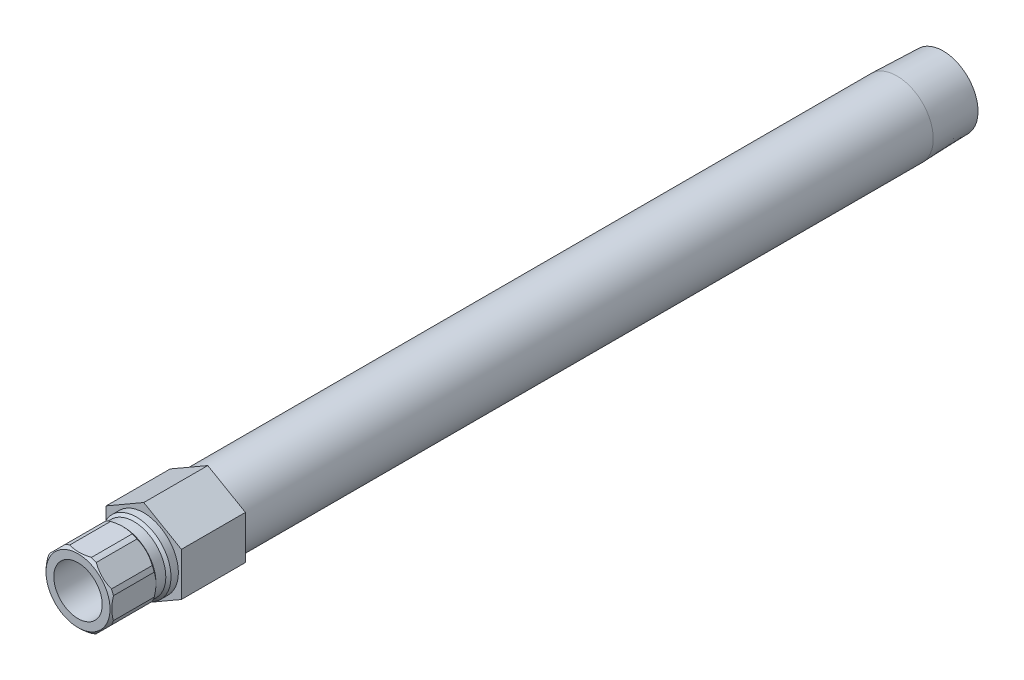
ISO-10303-21;
HEADER;
FILE_DESCRIPTION(('STEP AP214'),'2;1');
FILE_NAME('part.step','',(''),(''),'','','');
FILE_SCHEMA(('AUTOMOTIVE_DESIGN { 1 0 10303 214 1 1 1 1 }'));
ENDSEC;
DATA;
#1=APPLICATION_CONTEXT('core data for automotive mechanical design processes');
#2=APPLICATION_PROTOCOL_DEFINITION('international standard','automotive_design',2000,#1);
#3=PRODUCT_CONTEXT('',#1,'mechanical');
#4=PRODUCT('Part','Part','',(#3));
#5=PRODUCT_RELATED_PRODUCT_CATEGORY('part','',(#4));
#6=PRODUCT_DEFINITION_FORMATION('','',#4);
#7=PRODUCT_DEFINITION_CONTEXT('part definition',#1,'design');
#8=PRODUCT_DEFINITION('design','',#6,#7);
#9=PRODUCT_DEFINITION_SHAPE('','',#8);
#10=(LENGTH_UNIT() NAMED_UNIT(*) SI_UNIT(.MILLI.,.METRE.));
#11=(NAMED_UNIT(*) PLANE_ANGLE_UNIT() SI_UNIT($,.RADIAN.));
#12=(NAMED_UNIT(*) SI_UNIT($,.STERADIAN.) SOLID_ANGLE_UNIT());
#13=UNCERTAINTY_MEASURE_WITH_UNIT(LENGTH_MEASURE(1.E-05),#10,'distance_accuracy_value','');
#14=(GEOMETRIC_REPRESENTATION_CONTEXT(3) GLOBAL_UNCERTAINTY_ASSIGNED_CONTEXT((#13)) GLOBAL_UNIT_ASSIGNED_CONTEXT((#10,
#11,#12)) REPRESENTATION_CONTEXT('',''));
#15=CARTESIAN_POINT('',(0.,0.,0.));
#16=DIRECTION('',(0.,0.,1.));
#17=DIRECTION('',(1.,0.,0.));
#18=AXIS2_PLACEMENT_3D('',#15,#16,#17);
#19=CARTESIAN_POINT('',(0.,0.,0.));
#20=DIRECTION('',(0.,0.,-1.));
#21=DIRECTION('',(0.,1.,0.));
#22=AXIS2_PLACEMENT_3D('',#19,#20,#21);
#23=CYLINDRICAL_SURFACE('',#22,10.16);
#24=DIRECTION('',(0.,0.,-1.));
#25=VECTOR('',#24,1.);
#26=CARTESIAN_POINT('',(9.06826191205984,-4.58172739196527,0.));
#27=LINE('',#26,#25);
#28=CARTESIAN_POINT('',(9.06826191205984,-4.58172739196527,6.5786));
#29=VERTEX_POINT('',#28);
#30=CARTESIAN_POINT('',(9.06826191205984,-4.58172739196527,18.542));
#31=VERTEX_POINT('',#30);
#32=EDGE_CURVE('E535',#29,#31,#27,.F.);
#33=ORIENTED_EDGE('',*,*,#32,.F.);
#34=CARTESIAN_POINT('',(0.,0.,6.5786));
#35=DIRECTION('',(0.,0.,-1.));
#36=DIRECTION('',(0.,1.,0.));
#37=AXIS2_PLACEMENT_3D('',#34,#35,#36);
#38=CIRCLE('',#37,10.16);
#39=CARTESIAN_POINT('',(9.652,-3.17245898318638,6.5786));
#40=VERTEX_POINT('',#39);
#41=EDGE_CURVE('E214',#40,#29,#38,.T.);
#42=ORIENTED_EDGE('',*,*,#41,.F.);
#43=DIRECTION('',(0.,0.,-1.));
#44=VECTOR('',#43,1.);
#45=CARTESIAN_POINT('',(9.652,-3.17245898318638,0.));
#46=LINE('',#45,#44);
#47=CARTESIAN_POINT('',(9.652,-3.17245898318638,18.542));
#48=VERTEX_POINT('',#47);
#49=EDGE_CURVE('E410',#48,#40,#46,.T.);
#50=ORIENTED_EDGE('',*,*,#49,.F.);
#51=CARTESIAN_POINT('',(0.,0.,18.542));
#52=DIRECTION('',(0.,0.,-1.));
#53=DIRECTION('',(0.,1.,0.));
#54=AXIS2_PLACEMENT_3D('',#51,#52,#53);
#55=CIRCLE('',#54,10.16);
#56=EDGE_CURVE('E424',#48,#31,#55,.T.);
#57=ORIENTED_EDGE('',*,*,#56,.T.);
#58=EDGE_LOOP('',(#33,#42,#50,#57));
#59=FACE_BOUND('',#58,.T.);
#60=ADVANCED_FACE('F34',(#59),#23,.T.);
#61=DIRECTION('',(0.,0.,-1.));
#62=VECTOR('',#61,1.);
#63=CARTESIAN_POINT('',(9.652,3.17245898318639,0.));
#64=LINE('',#63,#62);
#65=CARTESIAN_POINT('',(9.652,3.1724589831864,6.57859999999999));
#66=VERTEX_POINT('',#65);
#67=CARTESIAN_POINT('',(9.652,3.17245898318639,18.542));
#68=VERTEX_POINT('',#67);
#69=EDGE_CURVE('E331',#66,#68,#64,.F.);
#70=ORIENTED_EDGE('',*,*,#69,.F.);
#71=CARTESIAN_POINT('',(9.06826191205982,4.5817273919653,6.5786));
#72=VERTEX_POINT('',#71);
#73=EDGE_CURVE('E217',#72,#66,#38,.T.);
#74=ORIENTED_EDGE('',*,*,#73,.F.);
#75=DIRECTION('',(0.,0.,-1.));
#76=VECTOR('',#75,1.);
#77=CARTESIAN_POINT('',(9.06826191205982,4.5817273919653,0.));
#78=LINE('',#77,#76);
#79=CARTESIAN_POINT('',(9.06826191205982,4.5817273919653,18.542));
#80=VERTEX_POINT('',#79);
#81=EDGE_CURVE('E403',#80,#72,#78,.T.);
#82=ORIENTED_EDGE('',*,*,#81,.F.);
#83=EDGE_CURVE('E231',#80,#68,#55,.T.);
#84=ORIENTED_EDGE('',*,*,#83,.T.);
#85=EDGE_LOOP('',(#70,#74,#82,#84));
#86=FACE_BOUND('',#85,.T.);
#87=ADVANCED_FACE('F425',(#86),#23,.T.);
#88=DIRECTION('',(0.,0.,-1.));
#89=VECTOR('',#88,1.);
#90=CARTESIAN_POINT('',(4.58172739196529,9.06826191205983,0.));
#91=LINE('',#90,#89);
#92=CARTESIAN_POINT('',(4.58172739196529,9.06826191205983,6.5786));
#93=VERTEX_POINT('',#92);
#94=CARTESIAN_POINT('',(4.58172739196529,9.06826191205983,18.542));
#95=VERTEX_POINT('',#94);
#96=EDGE_CURVE('E404',#93,#95,#91,.F.);
#97=ORIENTED_EDGE('',*,*,#96,.F.);
#98=CARTESIAN_POINT('',(3.17245898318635,9.65200000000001,6.5786));
#99=VERTEX_POINT('',#98);
#100=EDGE_CURVE('E219',#99,#93,#38,.T.);
#101=ORIENTED_EDGE('',*,*,#100,.F.);
#102=DIRECTION('',(0.,0.,-1.));
#103=VECTOR('',#102,1.);
#104=CARTESIAN_POINT('',(3.17245898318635,9.65200000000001,0.));
#105=LINE('',#104,#103);
#106=CARTESIAN_POINT('',(3.17245898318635,9.65200000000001,18.542));
#107=VERTEX_POINT('',#106);
#108=EDGE_CURVE('E397',#107,#99,#105,.T.);
#109=ORIENTED_EDGE('',*,*,#108,.F.);
#110=EDGE_CURVE('E227',#107,#95,#55,.T.);
#111=ORIENTED_EDGE('',*,*,#110,.T.);
#112=EDGE_LOOP('',(#97,#101,#109,#111));
#113=FACE_BOUND('',#112,.T.);
#114=ADVANCED_FACE('F444',(#113),#23,.T.);
#115=DIRECTION('',(0.,0.,-1.));
#116=VECTOR('',#115,1.);
#117=CARTESIAN_POINT('',(-3.17245898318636,9.65200000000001,0.));
#118=LINE('',#117,#116);
#119=CARTESIAN_POINT('',(-3.17245898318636,9.65200000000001,6.5786));
#120=VERTEX_POINT('',#119);
#121=CARTESIAN_POINT('',(-3.17245898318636,9.65200000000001,18.542));
#122=VERTEX_POINT('',#121);
#123=EDGE_CURVE('E398',#120,#122,#118,.F.);
#124=ORIENTED_EDGE('',*,*,#123,.F.);
#125=CARTESIAN_POINT('',(-4.5817273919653,9.06826191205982,6.5786));
#126=VERTEX_POINT('',#125);
#127=EDGE_CURVE('E224',#126,#120,#38,.T.);
#128=ORIENTED_EDGE('',*,*,#127,.F.);
#129=DIRECTION('',(0.,0.,-1.));
#130=VECTOR('',#129,1.);
#131=CARTESIAN_POINT('',(-4.5817273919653,9.06826191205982,0.));
#132=LINE('',#131,#130);
#133=CARTESIAN_POINT('',(-4.5817273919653,9.06826191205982,18.542));
#134=VERTEX_POINT('',#133);
#135=EDGE_CURVE('E54',#134,#126,#132,.T.);
#136=ORIENTED_EDGE('',*,*,#135,.F.);
#137=EDGE_CURVE('E223',#134,#122,#55,.T.);
#138=ORIENTED_EDGE('',*,*,#137,.T.);
#139=EDGE_LOOP('',(#124,#128,#136,#138));
#140=FACE_BOUND('',#139,.T.);
#141=ADVANCED_FACE('F439',(#140),#23,.T.);
#142=DIRECTION('',(0.,0.,-1.));
#143=VECTOR('',#142,1.);
#144=CARTESIAN_POINT('',(-9.06826191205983,4.58172739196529,0.));
#145=LINE('',#144,#143);
#146=CARTESIAN_POINT('',(-9.06826191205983,4.58172739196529,6.5786));
#147=VERTEX_POINT('',#146);
#148=CARTESIAN_POINT('',(-9.06826191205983,4.58172739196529,18.542));
#149=VERTEX_POINT('',#148);
#150=EDGE_CURVE('E394',#147,#149,#145,.F.);
#151=ORIENTED_EDGE('',*,*,#150,.F.);
#152=CARTESIAN_POINT('',(-9.652,3.17245898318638,6.5786));
#153=VERTEX_POINT('',#152);
#154=EDGE_CURVE('E447',#153,#147,#38,.T.);
#155=ORIENTED_EDGE('',*,*,#154,.F.);
#156=DIRECTION('',(0.,0.,-1.));
#157=VECTOR('',#156,1.);
#158=CARTESIAN_POINT('',(-9.652,3.17245898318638,0.));
#159=LINE('',#158,#157);
#160=CARTESIAN_POINT('',(-9.652,3.17245898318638,18.542));
#161=VERTEX_POINT('',#160);
#162=EDGE_CURVE('E62',#161,#153,#159,.T.);
#163=ORIENTED_EDGE('',*,*,#162,.F.);
#164=EDGE_CURVE('E430',#161,#149,#55,.T.);
#165=ORIENTED_EDGE('',*,*,#164,.T.);
#166=EDGE_LOOP('',(#151,#155,#163,#165));
#167=FACE_BOUND('',#166,.T.);
#168=ADVANCED_FACE('F554',(#167),#23,.T.);
#169=DIRECTION('',(0.,0.,-1.));
#170=VECTOR('',#169,1.);
#171=CARTESIAN_POINT('',(-9.652,-3.17245898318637,0.));
#172=LINE('',#171,#170);
#173=CARTESIAN_POINT('',(-9.652,-3.17245898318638,6.5786));
#174=VERTEX_POINT('',#173);
#175=CARTESIAN_POINT('',(-9.652,-3.17245898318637,18.542));
#176=VERTEX_POINT('',#175);
#177=EDGE_CURVE('E392',#174,#176,#172,.F.);
#178=ORIENTED_EDGE('',*,*,#177,.F.);
#179=CARTESIAN_POINT('',(-9.06826191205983,-4.58172739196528,6.5786));
#180=VERTEX_POINT('',#179);
#181=EDGE_CURVE('E218',#180,#174,#38,.T.);
#182=ORIENTED_EDGE('',*,*,#181,.F.);
#183=DIRECTION('',(0.,0.,-1.));
#184=VECTOR('',#183,1.);
#185=CARTESIAN_POINT('',(-9.06826191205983,-4.58172739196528,0.));
#186=LINE('',#185,#184);
#187=CARTESIAN_POINT('',(-9.06826191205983,-4.58172739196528,18.542));
#188=VERTEX_POINT('',#187);
#189=EDGE_CURVE('E269',#188,#180,#186,.T.);
#190=ORIENTED_EDGE('',*,*,#189,.F.);
#191=EDGE_CURVE('E428',#188,#176,#55,.T.);
#192=ORIENTED_EDGE('',*,*,#191,.T.);
#193=EDGE_LOOP('',(#178,#182,#190,#192));
#194=FACE_BOUND('',#193,.T.);
#195=ADVANCED_FACE('F548',(#194),#23,.T.);
#196=DIRECTION('',(0.,0.,-1.));
#197=VECTOR('',#196,1.);
#198=CARTESIAN_POINT('',(-4.58172739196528,-9.06826191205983,0.));
#199=LINE('',#198,#197);
#200=CARTESIAN_POINT('',(-4.58172739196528,-9.06826191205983,6.5786));
#201=VERTEX_POINT('',#200);
#202=CARTESIAN_POINT('',(-4.58172739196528,-9.06826191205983,18.542));
#203=VERTEX_POINT('',#202);
#204=EDGE_CURVE('E382',#201,#203,#199,.F.);
#205=ORIENTED_EDGE('',*,*,#204,.F.);
#206=CARTESIAN_POINT('',(-3.17245898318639,-9.65199999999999,6.5786));
#207=VERTEX_POINT('',#206);
#208=EDGE_CURVE('E215',#207,#201,#38,.T.);
#209=ORIENTED_EDGE('',*,*,#208,.F.);
#210=DIRECTION('',(0.,0.,-1.));
#211=VECTOR('',#210,1.);
#212=CARTESIAN_POINT('',(-3.17245898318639,-9.65199999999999,0.));
#213=LINE('',#212,#211);
#214=CARTESIAN_POINT('',(-3.17245898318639,-9.65199999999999,18.542));
#215=VERTEX_POINT('',#214);
#216=EDGE_CURVE('E192',#215,#207,#213,.T.);
#217=ORIENTED_EDGE('',*,*,#216,.F.);
#218=EDGE_CURVE('E391',#215,#203,#55,.T.);
#219=ORIENTED_EDGE('',*,*,#218,.T.);
#220=EDGE_LOOP('',(#205,#209,#217,#219));
#221=FACE_BOUND('',#220,.T.);
#222=ADVANCED_FACE('F389',(#221),#23,.T.);
#223=CARTESIAN_POINT('',(0.,0.,0.));
#224=DIRECTION('',(0.,0.,-1.));
#225=DIRECTION('',(0.,1.,0.));
#226=AXIS2_PLACEMENT_3D('',#223,#224,#225);
#227=CYLINDRICAL_SURFACE('',#226,7.112);
#228=CARTESIAN_POINT('',(0.,0.,1.524));
#229=DIRECTION('',(0.,0.,-1.));
#230=DIRECTION('',(0.,1.,0.));
#231=AXIS2_PLACEMENT_3D('',#228,#229,#230);
#232=CIRCLE('',#231,7.112);
#233=CARTESIAN_POINT('',(0.,7.112,1.524));
#234=VERTEX_POINT('',#233);
#235=EDGE_CURVE('E474',#234,#234,#232,.T.);
#236=ORIENTED_EDGE('',*,*,#235,.T.);
#237=EDGE_LOOP('',(#236));
#238=FACE_BOUND('',#237,.T.);
#239=CARTESIAN_POINT('',(0.,0.,19.304));
#240=DIRECTION('',(0.,0.,-1.));
#241=DIRECTION('',(0.,1.,0.));
#242=AXIS2_PLACEMENT_3D('',#239,#240,#241);
#243=CIRCLE('',#242,7.112);
#244=CARTESIAN_POINT('',(0.,7.112,19.304));
#245=VERTEX_POINT('',#244);
#246=EDGE_CURVE('E234',#245,#245,#243,.T.);
#247=ORIENTED_EDGE('',*,*,#246,.F.);
#248=EDGE_LOOP('',(#247));
#249=FACE_BOUND('',#248,.T.);
#250=ADVANCED_FACE('F36',(#238,#249),#227,.F.);
#251=CARTESIAN_POINT('',(0.,7.112,19.304));
#252=DIRECTION('',(0.,0.,1.));
#253=DIRECTION('',(0.,-1.,0.));
#254=AXIS2_PLACEMENT_3D('',#251,#252,#253);
#255=PLANE('',#254);
#256=ORIENTED_EDGE('',*,*,#246,.T.);
#257=EDGE_LOOP('',(#256));
#258=FACE_BOUND('',#257,.T.);
#259=CARTESIAN_POINT('',(0.,0.,19.304));
#260=DIRECTION('',(0.,0.,-1.));
#261=DIRECTION('',(0.,1.,0.));
#262=AXIS2_PLACEMENT_3D('',#259,#260,#261);
#263=CIRCLE('',#262,9.398);
#264=CARTESIAN_POINT('',(0.,9.398,19.304));
#265=VERTEX_POINT('',#264);
#266=EDGE_CURVE('E230',#265,#265,#263,.T.);
#267=ORIENTED_EDGE('',*,*,#266,.F.);
#268=EDGE_LOOP('',(#267));
#269=FACE_BOUND('',#268,.T.);
#270=ADVANCED_FACE('F275',(#258,#269),#255,.T.);
#271=CARTESIAN_POINT('',(0.,0.,18.542));
#272=DIRECTION('',(0.,0.,-1.));
#273=DIRECTION('',(0.,1.,0.));
#274=AXIS2_PLACEMENT_3D('',#271,#272,#273);
#275=CONICAL_SURFACE('',#274,10.16,0.785398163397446);
#276=CARTESIAN_POINT('',(9.06871478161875,-4.58127452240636,18.5418));
#277=CARTESIAN_POINT('',(8.8974665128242,-4.7525227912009,18.6174888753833));
#278=CARTESIAN_POINT('',(8.72454398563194,-4.92544531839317,18.6860001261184));
#279=CARTESIAN_POINT('',(8.37571487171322,-5.27427443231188,18.8068689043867));
#280=CARTESIAN_POINT('',(8.1998052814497,-5.4501840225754,18.85920901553));
#281=CARTESIAN_POINT('',(7.84982827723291,-5.80016102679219,18.9447662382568));
#282=CARTESIAN_POINT('',(7.67581225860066,-5.97417704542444,18.9783973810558));
#283=CARTESIAN_POINT('',(7.32656572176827,-6.32342358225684,19.0270891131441));
#284=CARTESIAN_POINT('',(7.1513358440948,-6.4986534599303,19.0421588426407));
#285=CARTESIAN_POINT('',(6.77605057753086,-6.87393872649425,19.0538859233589));
#286=CARTESIAN_POINT('',(6.57594647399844,-7.07404283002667,19.0476773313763));
#287=CARTESIAN_POINT('',(6.17675989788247,-7.47322940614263,19.0106603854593));
#288=CARTESIAN_POINT('',(5.97767829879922,-7.67231100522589,18.9798336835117));
#289=CARTESIAN_POINT('',(5.57666706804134,-8.07332223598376,18.8939894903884));
#290=CARTESIAN_POINT('',(5.37480504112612,-8.27518426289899,18.8383431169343));
#291=CARTESIAN_POINT('',(5.07491153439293,-8.57507776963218,18.7386783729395));
#292=CARTESIAN_POINT('',(4.97548345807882,-8.67450584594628,18.7027814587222));
#293=CARTESIAN_POINT('',(4.77762502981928,-8.87236427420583,18.6259657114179));
#294=CARTESIAN_POINT('',(4.67919445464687,-8.97079484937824,18.5850480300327));
#295=CARTESIAN_POINT('',(4.58127452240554,-9.06871478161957,18.5417999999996));
#296=B_SPLINE_CURVE_WITH_KNOTS('',3,(#276,#277,#278,#279,#280,#281,#282,#283,#284,#285,#286,
#287,#288,#289,#290,#291,#292,#293,#294,#295),.UNSPECIFIED.,.F.,.F.,(4,2,2,2,2,2,2,2,2,4),(0.,
0.761268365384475,1.52335378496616,2.26782503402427,3.01192953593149,3.85997332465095,
4.70864975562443,5.5801727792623,6.01546212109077,6.45065179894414),.UNSPECIFIED.);
#297=CARTESIAN_POINT('',(4.58172739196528,-9.06826191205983,18.542));
#298=VERTEX_POINT('',#297);
#299=EDGE_CURVE('E530',#31,#298,#296,.T.);
#300=ORIENTED_EDGE('',*,*,#299,.F.);
#301=ORIENTED_EDGE('',*,*,#56,.F.);
#302=CARTESIAN_POINT('',(9.652,-7.71050187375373,16.3483388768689));
#303=CARTESIAN_POINT('',(9.652,-7.52475481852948,16.4642553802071));
#304=CARTESIAN_POINT('',(9.652,-7.33786285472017,16.5783624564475));
#305=CARTESIAN_POINT('',(9.652,-6.96152272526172,16.8023812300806));
#306=CARTESIAN_POINT('',(9.652,-6.77207395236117,16.9122919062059));
#307=CARTESIAN_POINT('',(9.652,-6.38961701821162,17.1277502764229));
#308=CARTESIAN_POINT('',(9.652,-6.19659699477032,17.2332770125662));
#309=CARTESIAN_POINT('',(9.652,-5.8076024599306,17.4386922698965));
#310=CARTESIAN_POINT('',(9.652,-5.61162813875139,17.5385811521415));
#311=CARTESIAN_POINT('',(9.652,-5.01021259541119,17.8328232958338));
#312=CARTESIAN_POINT('',(9.652,-4.59965798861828,18.0169416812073));
#313=CARTESIAN_POINT('',(9.652,-3.76461195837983,18.3488686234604));
#314=CARTESIAN_POINT('',(9.652,-3.34014745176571,18.4967430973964));
#315=CARTESIAN_POINT('',(9.652,-2.66836152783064,18.6905975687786));
#316=CARTESIAN_POINT('',(9.652,-2.42567962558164,18.7527238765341));
#317=CARTESIAN_POINT('',(9.652,-1.93662453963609,18.860517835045));
#318=CARTESIAN_POINT('',(9.652,-1.69025117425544,18.9061846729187));
#319=CARTESIAN_POINT('',(9.652,-1.1971622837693,18.9790662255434));
#320=CARTESIAN_POINT('',(9.652,-0.950472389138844,19.0064526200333));
#321=CARTESIAN_POINT('',(9.652,-0.455710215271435,19.0423990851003));
#322=CARTESIAN_POINT('',(9.652,-0.207637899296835,19.0509586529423));
#323=CARTESIAN_POINT('',(9.652,0.333683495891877,19.048681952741));
#324=CARTESIAN_POINT('',(9.652,0.626923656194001,19.0340251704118));
#325=CARTESIAN_POINT('',(9.652,1.21094277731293,18.9786837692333));
#326=CARTESIAN_POINT('',(9.652,1.50172122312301,18.9379938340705));
#327=CARTESIAN_POINT('',(9.652,2.08266136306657,18.8320509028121));
#328=CARTESIAN_POINT('',(9.652,2.37276468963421,18.7664820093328));
#329=CARTESIAN_POINT('',(9.652,2.94714147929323,18.6138865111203));
#330=CARTESIAN_POINT('',(9.652,3.2314158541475,18.5268632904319));
#331=CARTESIAN_POINT('',(9.652,3.82869981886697,18.3226103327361));
#332=CARTESIAN_POINT('',(9.652,4.14087760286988,18.2029681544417));
#333=CARTESIAN_POINT('',(9.652,4.75742701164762,17.9448741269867));
#334=CARTESIAN_POINT('',(9.652,5.06179505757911,17.8064138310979));
#335=CARTESIAN_POINT('',(9.652,5.66409479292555,17.5139015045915));
#336=CARTESIAN_POINT('',(9.652,5.9620026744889,17.3598008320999));
#337=CARTESIAN_POINT('',(9.652,6.55107386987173,17.0393844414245));
#338=CARTESIAN_POINT('',(9.652,6.84223818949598,16.8730705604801));
#339=CARTESIAN_POINT('',(9.652,7.40668231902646,16.5376791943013));
#340=CARTESIAN_POINT('',(9.652,7.68020242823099,16.3690040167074));
#341=CARTESIAN_POINT('',(9.652,8.22250898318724,16.0241853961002));
#342=CARTESIAN_POINT('',(9.652,8.49129505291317,15.848041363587));
#343=CARTESIAN_POINT('',(9.652,9.02258177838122,15.4910339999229));
#344=CARTESIAN_POINT('',(9.652,9.28511552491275,15.3102197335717));
#345=CARTESIAN_POINT('',(9.652,9.80652727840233,14.9435456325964));
#346=CARTESIAN_POINT('',(9.652,10.0654063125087,14.7576872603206));
#347=CARTESIAN_POINT('',(9.652,10.3227473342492,14.5697596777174));
#348=B_SPLINE_CURVE_WITH_KNOTS('',3,(#302,#303,#304,#305,#306,#307,#308,#309,#310,#311,#312,
#313,#314,#315,#316,#317,#318,#319,#320,#321,#322,#323,#324,#325,#326,#327,#328,#329,#330,#331,
#332,#333,#334,#335,#336,#337,#338,#339,#340,#341,#342,#343,#344,#345,#346,#347),.UNSPECIFIED.,
.F.,.F.,(4,2,2,2,2,2,2,2,2,2,2,2,2,2,2,2,2,2,2,2,2,2,4),(0.,0.656855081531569,1.31386901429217,
1.97372850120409,2.63354568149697,3.98211483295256,5.32821282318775,6.07925616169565,
6.83033658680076,7.5742601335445,8.31820354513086,9.1977741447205,10.0775244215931,
10.9688407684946,11.8600166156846,12.8622077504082,13.8648502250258,14.8707124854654,
15.8764237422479,16.8403261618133,17.8043048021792,18.7605668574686,19.7165545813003),.UNSPECIFIED.);
#349=EDGE_CURVE('E323',#68,#48,#348,.F.);
#350=ORIENTED_EDGE('',*,*,#349,.F.);
#351=ORIENTED_EDGE('',*,*,#83,.F.);
#352=CARTESIAN_POINT('',(4.58127452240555,9.06871478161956,18.5417999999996));
#353=CARTESIAN_POINT('',(4.75252279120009,8.89746651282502,18.617488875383));
#354=CARTESIAN_POINT('',(4.92544531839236,8.72454398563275,18.6860001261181));
#355=CARTESIAN_POINT('',(5.27427443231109,8.37571487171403,18.8068689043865));
#356=CARTESIAN_POINT('',(5.45018402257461,8.19980528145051,18.8592090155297));
#357=CARTESIAN_POINT('',(5.8001610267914,7.84982827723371,18.9447662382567));
#358=CARTESIAN_POINT('',(5.97417704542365,7.67581225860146,18.9783973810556));
#359=CARTESIAN_POINT('',(6.32342358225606,7.32656572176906,19.027089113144));
#360=CARTESIAN_POINT('',(6.49865345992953,7.15133584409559,19.0421588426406));
#361=CARTESIAN_POINT('',(6.87393872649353,6.77605057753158,19.0538859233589));
#362=CARTESIAN_POINT('',(7.07404283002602,6.5759464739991,19.0476773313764));
#363=CARTESIAN_POINT('',(7.47322940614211,6.17675989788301,19.0106603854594));
#364=CARTESIAN_POINT('',(7.67231100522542,5.97767829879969,18.9798336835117));
#365=CARTESIAN_POINT('',(8.07332223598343,5.57666706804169,18.8939894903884));
#366=CARTESIAN_POINT('',(8.27518426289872,5.37480504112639,18.8383431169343));
#367=CARTESIAN_POINT('',(8.57507776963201,5.07491153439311,18.7386783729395));
#368=CARTESIAN_POINT('',(8.67450584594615,4.97548345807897,18.7027814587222));
#369=CARTESIAN_POINT('',(8.87236427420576,4.77762502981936,18.6259657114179));
#370=CARTESIAN_POINT('',(8.9707948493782,4.67919445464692,18.5850480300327));
#371=CARTESIAN_POINT('',(9.06871478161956,4.58127452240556,18.5417999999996));
#372=B_SPLINE_CURVE_WITH_KNOTS('',3,(#352,#353,#354,#355,#356,#357,#358,#359,#360,#361,#362,
#363,#364,#365,#366,#367,#368,#369,#370,#371),.UNSPECIFIED.,.F.,.F.,(4,2,2,2,2,2,2,2,2,4),(0.,
0.761268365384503,1.52335378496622,2.26782503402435,3.01192953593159,3.85997332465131,
4.70864975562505,5.5801727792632,6.01546212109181,6.45065179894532),.UNSPECIFIED.);
#373=EDGE_CURVE('E315',#95,#80,#372,.T.);
#374=ORIENTED_EDGE('',*,*,#373,.F.);
#375=ORIENTED_EDGE('',*,*,#110,.F.);
#376=CARTESIAN_POINT('',(-7.71050187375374,9.65200000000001,16.3483388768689));
#377=CARTESIAN_POINT('',(-7.52475481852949,9.65200000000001,16.4642553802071));
#378=CARTESIAN_POINT('',(-7.33786285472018,9.65200000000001,16.5783624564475));
#379=CARTESIAN_POINT('',(-6.96152272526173,9.65200000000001,16.8023812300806));
#380=CARTESIAN_POINT('',(-6.77207395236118,9.65200000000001,16.9122919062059));
#381=CARTESIAN_POINT('',(-6.38961701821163,9.65200000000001,17.1277502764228));
#382=CARTESIAN_POINT('',(-6.19659699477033,9.65200000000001,17.2332770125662));
#383=CARTESIAN_POINT('',(-5.8076024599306,9.65200000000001,17.4386922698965));
#384=CARTESIAN_POINT('',(-5.6116281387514,9.65200000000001,17.5385811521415));
#385=CARTESIAN_POINT('',(-5.01021259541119,9.65200000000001,17.8328232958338));
#386=CARTESIAN_POINT('',(-4.59965798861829,9.65200000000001,18.0169416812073));
#387=CARTESIAN_POINT('',(-3.76461195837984,9.65200000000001,18.3488686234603));
#388=CARTESIAN_POINT('',(-3.34014745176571,9.65200000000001,18.4967430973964));
#389=CARTESIAN_POINT('',(-2.66836152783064,9.65200000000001,18.6905975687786));
#390=CARTESIAN_POINT('',(-2.42567962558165,9.65200000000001,18.7527238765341));
#391=CARTESIAN_POINT('',(-1.9366245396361,9.65200000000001,18.860517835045));
#392=CARTESIAN_POINT('',(-1.69025117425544,9.65200000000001,18.9061846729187));
#393=CARTESIAN_POINT('',(-1.1971622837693,9.65200000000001,18.9790662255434));
#394=CARTESIAN_POINT('',(-0.950472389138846,9.65200000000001,19.0064526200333));
#395=CARTESIAN_POINT('',(-0.455710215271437,9.65200000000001,19.0423990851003));
#396=CARTESIAN_POINT('',(-0.207637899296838,9.65200000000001,19.0509586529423));
#397=CARTESIAN_POINT('',(0.333683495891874,9.65200000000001,19.0486819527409));
#398=CARTESIAN_POINT('',(0.626923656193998,9.65200000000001,19.0340251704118));
#399=CARTESIAN_POINT('',(1.21094277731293,9.65200000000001,18.9786837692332));
#400=CARTESIAN_POINT('',(1.501721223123,9.65200000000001,18.9379938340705));
#401=CARTESIAN_POINT('',(2.08266136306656,9.65200000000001,18.832050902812));
#402=CARTESIAN_POINT('',(2.3727646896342,9.65200000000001,18.7664820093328));
#403=CARTESIAN_POINT('',(2.94714147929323,9.65200000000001,18.6138865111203));
#404=CARTESIAN_POINT('',(3.23141585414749,9.65200000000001,18.5268632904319));
#405=CARTESIAN_POINT('',(3.82869981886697,9.65200000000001,18.3226103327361));
#406=CARTESIAN_POINT('',(4.14087760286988,9.65200000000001,18.2029681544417));
#407=CARTESIAN_POINT('',(4.75742701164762,9.65200000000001,17.9448741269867));
#408=CARTESIAN_POINT('',(5.0617950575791,9.65200000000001,17.8064138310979));
#409=CARTESIAN_POINT('',(5.66409479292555,9.65200000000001,17.5139015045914));
#410=CARTESIAN_POINT('',(5.9620026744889,9.65200000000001,17.3598008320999));
#411=CARTESIAN_POINT('',(6.55107386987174,9.65200000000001,17.0393844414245));
#412=CARTESIAN_POINT('',(6.84223818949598,9.65200000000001,16.8730705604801));
#413=CARTESIAN_POINT('',(7.40668231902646,9.65200000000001,16.5376791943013));
#414=CARTESIAN_POINT('',(7.680202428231,9.65200000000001,16.3690040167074));
#415=CARTESIAN_POINT('',(8.22250898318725,9.65200000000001,16.0241853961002));
#416=CARTESIAN_POINT('',(8.49129505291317,9.65200000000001,15.8480413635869));
#417=CARTESIAN_POINT('',(9.02258177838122,9.65200000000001,15.4910339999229));
#418=CARTESIAN_POINT('',(9.28511552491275,9.65200000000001,15.3102197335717));
#419=CARTESIAN_POINT('',(9.80652727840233,9.65200000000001,14.9435456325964));
#420=CARTESIAN_POINT('',(10.0654063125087,9.65200000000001,14.7576872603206));
#421=CARTESIAN_POINT('',(10.3227473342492,9.65200000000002,14.5697596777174));
#422=B_SPLINE_CURVE_WITH_KNOTS('',3,(#376,#377,#378,#379,#380,#381,#382,#383,#384,#385,#386,
#387,#388,#389,#390,#391,#392,#393,#394,#395,#396,#397,#398,#399,#400,#401,#402,#403,#404,#405,
#406,#407,#408,#409,#410,#411,#412,#413,#414,#415,#416,#417,#418,#419,#420,#421),.UNSPECIFIED.,
.F.,.F.,(4,2,2,2,2,2,2,2,2,2,2,2,2,2,2,2,2,2,2,2,2,2,4),(0.,0.656855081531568,1.31386901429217,
1.97372850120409,2.63354568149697,3.98211483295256,5.32821282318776,6.07925616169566,
6.83033658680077,7.57426013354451,8.31820354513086,9.1977741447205,10.0775244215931,
10.9688407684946,11.8600166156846,12.8622077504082,13.8648502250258,14.8707124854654,
15.8764237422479,16.8403261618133,17.8043048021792,18.7605668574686,19.7165545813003),.UNSPECIFIED.);
#423=EDGE_CURVE('E307',#122,#107,#422,.T.);
#424=ORIENTED_EDGE('',*,*,#423,.F.);
#425=ORIENTED_EDGE('',*,*,#137,.F.);
#426=CARTESIAN_POINT('',(-9.06871478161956,4.58127452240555,18.5417999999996));
#427=CARTESIAN_POINT('',(-8.89746651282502,4.7525227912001,18.617488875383));
#428=CARTESIAN_POINT('',(-8.72454398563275,4.92544531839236,18.6860001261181));
#429=CARTESIAN_POINT('',(-8.37571487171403,5.27427443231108,18.8068689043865));
#430=CARTESIAN_POINT('',(-8.19980528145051,5.45018402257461,18.8592090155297));
#431=CARTESIAN_POINT('',(-7.84982827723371,5.8001610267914,18.9447662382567));
#432=CARTESIAN_POINT('',(-7.67581225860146,5.97417704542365,18.9783973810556));
#433=CARTESIAN_POINT('',(-7.32656572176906,6.32342358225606,19.027089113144));
#434=CARTESIAN_POINT('',(-7.15133584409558,6.49865345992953,19.0421588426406));
#435=CARTESIAN_POINT('',(-6.77605057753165,6.87393872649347,19.0538859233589));
#436=CARTESIAN_POINT('',(-6.57594647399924,7.07404283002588,19.0476773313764));
#437=CARTESIAN_POINT('',(-6.17675989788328,7.47322940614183,19.0106603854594));
#438=CARTESIAN_POINT('',(-5.97767829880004,7.67231100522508,18.9798336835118));
#439=CARTESIAN_POINT('',(-5.57666706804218,8.07332223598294,18.8939894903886));
#440=CARTESIAN_POINT('',(-5.37480504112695,8.27518426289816,18.8383431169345));
#441=CARTESIAN_POINT('',(-5.07491153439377,8.57507776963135,18.7386783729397));
#442=CARTESIAN_POINT('',(-4.97548345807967,8.67450584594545,18.7027814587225));
#443=CARTESIAN_POINT('',(-4.77762502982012,8.87236427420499,18.6259657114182));
#444=CARTESIAN_POINT('',(-4.67919445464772,8.9707948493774,18.585048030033));
#445=CARTESIAN_POINT('',(-4.58127452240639,9.06871478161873,18.5418));
#446=B_SPLINE_CURVE_WITH_KNOTS('',3,(#426,#427,#428,#429,#430,#431,#432,#433,#434,#435,#436,
#437,#438,#439,#440,#441,#442,#443,#444,#445),.UNSPECIFIED.,.F.,.F.,(4,2,2,2,2,2,2,2,2,4),(0.,
0.7612683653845,1.52335378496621,2.26782503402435,3.01192953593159,3.85997332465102,
4.70864975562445,5.58017277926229,6.01546212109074,6.45065179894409),.UNSPECIFIED.);
#447=EDGE_CURVE('E298',#149,#134,#446,.T.);
#448=ORIENTED_EDGE('',*,*,#447,.F.);
#449=ORIENTED_EDGE('',*,*,#164,.F.);
#450=CARTESIAN_POINT('',(-9.652,-7.71050187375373,16.3483388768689));
#451=CARTESIAN_POINT('',(-9.652,-7.52475481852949,16.4642553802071));
#452=CARTESIAN_POINT('',(-9.652,-7.33786285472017,16.5783624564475));
#453=CARTESIAN_POINT('',(-9.652,-6.96152272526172,16.8023812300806));
#454=CARTESIAN_POINT('',(-9.652,-6.77207395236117,16.9122919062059));
#455=CARTESIAN_POINT('',(-9.652,-6.38961701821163,17.1277502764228));
#456=CARTESIAN_POINT('',(-9.652,-6.19659699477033,17.2332770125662));
#457=CARTESIAN_POINT('',(-9.652,-5.8076024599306,17.4386922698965));
#458=CARTESIAN_POINT('',(-9.652,-5.6116281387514,17.5385811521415));
#459=CARTESIAN_POINT('',(-9.652,-5.01021259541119,17.8328232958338));
#460=CARTESIAN_POINT('',(-9.652,-4.59965798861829,18.0169416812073));
#461=CARTESIAN_POINT('',(-9.652,-3.76461195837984,18.3488686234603));
#462=CARTESIAN_POINT('',(-9.652,-3.34014745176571,18.4967430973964));
#463=CARTESIAN_POINT('',(-9.652,-2.66836152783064,18.6905975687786));
#464=CARTESIAN_POINT('',(-9.652,-2.42567962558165,18.7527238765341));
#465=CARTESIAN_POINT('',(-9.652,-1.9366245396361,18.860517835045));
#466=CARTESIAN_POINT('',(-9.652,-1.69025117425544,18.9061846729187));
#467=CARTESIAN_POINT('',(-9.652,-1.1971622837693,18.9790662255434));
#468=CARTESIAN_POINT('',(-9.652,-0.950472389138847,19.0064526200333));
#469=CARTESIAN_POINT('',(-9.652,-0.455710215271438,19.0423990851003));
#470=CARTESIAN_POINT('',(-9.652,-0.207637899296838,19.0509586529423));
#471=CARTESIAN_POINT('',(-9.652,0.333683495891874,19.0486819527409));
#472=CARTESIAN_POINT('',(-9.652,0.626923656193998,19.0340251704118));
#473=CARTESIAN_POINT('',(-9.652,1.21094277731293,18.9786837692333));
#474=CARTESIAN_POINT('',(-9.652,1.501721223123,18.9379938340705));
#475=CARTESIAN_POINT('',(-9.652,2.08266136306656,18.8320509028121));
#476=CARTESIAN_POINT('',(-9.652,2.3727646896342,18.7664820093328));
#477=CARTESIAN_POINT('',(-9.652,2.94714147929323,18.6138865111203));
#478=CARTESIAN_POINT('',(-9.652,3.2314158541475,18.5268632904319));
#479=CARTESIAN_POINT('',(-9.652,3.82869981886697,18.3226103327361));
#480=CARTESIAN_POINT('',(-9.652,4.14087760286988,18.2029681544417));
#481=CARTESIAN_POINT('',(-9.652,4.75742701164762,17.9448741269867));
#482=CARTESIAN_POINT('',(-9.652,5.06179505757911,17.8064138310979));
#483=CARTESIAN_POINT('',(-9.652,5.66409479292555,17.5139015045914));
#484=CARTESIAN_POINT('',(-9.652,5.9620026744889,17.3598008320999));
#485=CARTESIAN_POINT('',(-9.652,6.55107386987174,17.0393844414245));
#486=CARTESIAN_POINT('',(-9.652,6.84223818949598,16.8730705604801));
#487=CARTESIAN_POINT('',(-9.652,7.40668231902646,16.5376791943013));
#488=CARTESIAN_POINT('',(-9.652,7.68020242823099,16.3690040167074));
#489=CARTESIAN_POINT('',(-9.652,8.22250898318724,16.0241853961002));
#490=CARTESIAN_POINT('',(-9.652,8.49129505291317,15.848041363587));
#491=CARTESIAN_POINT('',(-9.652,9.02258177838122,15.4910339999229));
#492=CARTESIAN_POINT('',(-9.652,9.28511552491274,15.3102197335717));
#493=CARTESIAN_POINT('',(-9.652,9.80652727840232,14.9435456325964));
#494=CARTESIAN_POINT('',(-9.652,10.0654063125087,14.7576872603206));
#495=CARTESIAN_POINT('',(-9.652,10.3227473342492,14.5697596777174));
#496=B_SPLINE_CURVE_WITH_KNOTS('',3,(#450,#451,#452,#453,#454,#455,#456,#457,#458,#459,#460,
#461,#462,#463,#464,#465,#466,#467,#468,#469,#470,#471,#472,#473,#474,#475,#476,#477,#478,#479,
#480,#481,#482,#483,#484,#485,#486,#487,#488,#489,#490,#491,#492,#493,#494,#495),.UNSPECIFIED.,
.F.,.F.,(4,2,2,2,2,2,2,2,2,2,2,2,2,2,2,2,2,2,2,2,2,2,4),(0.,0.656855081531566,1.31386901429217,
1.97372850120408,2.63354568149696,3.98211483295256,5.32821282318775,6.07925616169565,
6.83033658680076,7.5742601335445,8.31820354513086,9.19777414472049,10.0775244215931,
10.9688407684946,11.8600166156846,12.8622077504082,13.8648502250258,14.8707124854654,
15.8764237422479,16.8403261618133,17.8043048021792,18.7605668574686,19.7165545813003),.UNSPECIFIED.);
#497=EDGE_CURVE('E290',#176,#161,#496,.T.);
#498=ORIENTED_EDGE('',*,*,#497,.F.);
#499=ORIENTED_EDGE('',*,*,#191,.F.);
#500=CARTESIAN_POINT('',(-4.58127452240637,-9.06871478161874,18.5418));
#501=CARTESIAN_POINT('',(-4.75252279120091,-8.8974665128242,18.6174888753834));
#502=CARTESIAN_POINT('',(-4.92544531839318,-8.72454398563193,18.6860001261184));
#503=CARTESIAN_POINT('',(-5.27427443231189,-8.37571487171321,18.8068689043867));
#504=CARTESIAN_POINT('',(-5.45018402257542,-8.19980528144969,18.85920901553));
#505=CARTESIAN_POINT('',(-5.8001610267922,-7.8498282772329,18.9447662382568));
#506=CARTESIAN_POINT('',(-5.97417704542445,-7.67581225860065,18.9783973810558));
#507=CARTESIAN_POINT('',(-6.32342358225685,-7.32656572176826,19.0270891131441));
#508=CARTESIAN_POINT('',(-6.49865345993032,-7.15133584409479,19.0421588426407));
#509=CARTESIAN_POINT('',(-6.87393872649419,-6.77605057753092,19.0538859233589));
#510=CARTESIAN_POINT('',(-7.07404283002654,-6.57594647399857,19.0476773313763));
#511=CARTESIAN_POINT('',(-7.47322940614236,-6.17675989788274,19.0106603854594));
#512=CARTESIAN_POINT('',(-7.67231100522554,-5.97767829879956,18.9798336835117));
#513=CARTESIAN_POINT('',(-8.07332223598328,-5.57666706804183,18.8939894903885));
#514=CARTESIAN_POINT('',(-8.27518426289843,-5.37480504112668,18.8383431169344));
#515=CARTESIAN_POINT('',(-8.57507776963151,-5.07491153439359,18.7386783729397));
#516=CARTESIAN_POINT('',(-8.67450584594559,-4.97548345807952,18.7027814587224));
#517=CARTESIAN_POINT('',(-8.87236427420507,-4.77762502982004,18.6259657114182));
#518=CARTESIAN_POINT('',(-8.97079484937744,-4.67919445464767,18.585048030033));
#519=CARTESIAN_POINT('',(-9.06871478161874,-4.58127452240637,18.5418));
#520=B_SPLINE_CURVE_WITH_KNOTS('',3,(#500,#501,#502,#503,#504,#505,#506,#507,#508,#509,#510,
#511,#512,#513,#514,#515,#516,#517,#518,#519),.UNSPECIFIED.,.F.,.F.,(4,2,2,2,2,2,2,2,2,4),(0.,
0.761268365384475,1.52335378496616,2.26782503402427,3.01192953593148,3.85997332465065,
4.70864975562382,5.58017277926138,6.01546212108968,6.4506517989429),.UNSPECIFIED.);
#521=EDGE_CURVE('E283',#203,#188,#520,.T.);
#522=ORIENTED_EDGE('',*,*,#521,.F.);
#523=ORIENTED_EDGE('',*,*,#218,.F.);
#524=CARTESIAN_POINT('',(-7.71050187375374,-9.652,16.3483388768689));
#525=CARTESIAN_POINT('',(-7.5247548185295,-9.652,16.4642553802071));
#526=CARTESIAN_POINT('',(-7.33786285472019,-9.652,16.5783624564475));
#527=CARTESIAN_POINT('',(-6.96152272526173,-9.652,16.8023812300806));
#528=CARTESIAN_POINT('',(-6.77207395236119,-9.652,16.9122919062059));
#529=CARTESIAN_POINT('',(-6.38961701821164,-9.652,17.1277502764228));
#530=CARTESIAN_POINT('',(-6.19659699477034,-9.652,17.2332770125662));
#531=CARTESIAN_POINT('',(-5.80760245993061,-9.652,17.4386922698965));
#532=CARTESIAN_POINT('',(-5.61162813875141,-9.65199999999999,17.5385811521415));
#533=CARTESIAN_POINT('',(-5.0102125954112,-9.65199999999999,17.8328232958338));
#534=CARTESIAN_POINT('',(-4.5996579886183,-9.65199999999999,18.0169416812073));
#535=CARTESIAN_POINT('',(-3.76461195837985,-9.65199999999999,18.3488686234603));
#536=CARTESIAN_POINT('',(-3.34014745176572,-9.65199999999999,18.4967430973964));
#537=CARTESIAN_POINT('',(-2.66836152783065,-9.65199999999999,18.6905975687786));
#538=CARTESIAN_POINT('',(-2.42567962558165,-9.65199999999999,18.7527238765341));
#539=CARTESIAN_POINT('',(-1.9366245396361,-9.65199999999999,18.860517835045));
#540=CARTESIAN_POINT('',(-1.69025117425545,-9.65199999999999,18.9061846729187));
#541=CARTESIAN_POINT('',(-1.19716228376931,-9.65199999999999,18.9790662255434));
#542=CARTESIAN_POINT('',(-0.950472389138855,-9.65199999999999,19.0064526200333));
#543=CARTESIAN_POINT('',(-0.455710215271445,-9.65199999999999,19.0423990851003));
#544=CARTESIAN_POINT('',(-0.207637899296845,-9.65199999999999,19.0509586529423));
#545=CARTESIAN_POINT('',(0.333683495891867,-9.65199999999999,19.048681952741));
#546=CARTESIAN_POINT('',(0.626923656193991,-9.65199999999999,19.0340251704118));
#547=CARTESIAN_POINT('',(1.21094277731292,-9.65199999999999,18.9786837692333));
#548=CARTESIAN_POINT('',(1.501721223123,-9.65199999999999,18.9379938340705));
#549=CARTESIAN_POINT('',(2.08266136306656,-9.65199999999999,18.8320509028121));
#550=CARTESIAN_POINT('',(2.3727646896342,-9.65199999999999,18.7664820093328));
#551=CARTESIAN_POINT('',(2.94714147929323,-9.65199999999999,18.6138865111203));
#552=CARTESIAN_POINT('',(3.23141585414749,-9.65199999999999,18.5268632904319));
#553=CARTESIAN_POINT('',(3.82869981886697,-9.65199999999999,18.3226103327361));
#554=CARTESIAN_POINT('',(4.14087760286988,-9.65199999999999,18.2029681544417));
#555=CARTESIAN_POINT('',(4.75742701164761,-9.65199999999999,17.9448741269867));
#556=CARTESIAN_POINT('',(5.0617950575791,-9.65199999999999,17.8064138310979));
#557=CARTESIAN_POINT('',(5.66409479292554,-9.65199999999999,17.5139015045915));
#558=CARTESIAN_POINT('',(5.96200267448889,-9.65199999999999,17.3598008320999));
#559=CARTESIAN_POINT('',(6.55107386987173,-9.65199999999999,17.0393844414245));
#560=CARTESIAN_POINT('',(6.84223818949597,-9.65199999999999,16.8730705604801));
#561=CARTESIAN_POINT('',(7.40668231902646,-9.65199999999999,16.5376791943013));
#562=CARTESIAN_POINT('',(7.68020242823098,-9.65199999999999,16.3690040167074));
#563=CARTESIAN_POINT('',(8.22250898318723,-9.65199999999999,16.0241853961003));
#564=CARTESIAN_POINT('',(8.49129505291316,-9.65199999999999,15.848041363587));
#565=CARTESIAN_POINT('',(9.02258177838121,-9.65199999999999,15.4910339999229));
#566=CARTESIAN_POINT('',(9.28511552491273,-9.65199999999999,15.3102197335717));
#567=CARTESIAN_POINT('',(9.80652727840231,-9.65199999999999,14.9435456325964));
#568=CARTESIAN_POINT('',(10.0654063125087,-9.65199999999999,14.7576872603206));
#569=CARTESIAN_POINT('',(10.3227473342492,-9.65199999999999,14.5697596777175));
#570=B_SPLINE_CURVE_WITH_KNOTS('',3,(#524,#525,#526,#527,#528,#529,#530,#531,#532,#533,#534,
#535,#536,#537,#538,#539,#540,#541,#542,#543,#544,#545,#546,#547,#548,#549,#550,#551,#552,#553,
#554,#555,#556,#557,#558,#559,#560,#561,#562,#563,#564,#565,#566,#567,#568,#569),.UNSPECIFIED.,
.F.,.F.,(4,2,2,2,2,2,2,2,2,2,2,2,2,2,2,2,2,2,2,2,2,2,4),(0.,0.656855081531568,1.31386901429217,
1.97372850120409,2.63354568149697,3.98211483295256,5.32821282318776,6.07925616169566,
6.83033658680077,7.57426013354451,8.31820354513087,9.1977741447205,10.0775244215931,
10.9688407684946,11.8600166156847,12.8622077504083,13.8648502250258,14.8707124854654,
15.8764237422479,16.8403261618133,17.8043048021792,18.7605668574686,19.7165545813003),.UNSPECIFIED.);
#571=CARTESIAN_POINT('',(3.1724589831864,-9.65199999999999,18.542));
#572=VERTEX_POINT('',#571);
#573=EDGE_CURVE('E208',#572,#215,#570,.F.);
#574=ORIENTED_EDGE('',*,*,#573,.F.);
#575=EDGE_CURVE('E207',#298,#572,#55,.T.);
#576=ORIENTED_EDGE('',*,*,#575,.F.);
#577=EDGE_LOOP('',(#300,#301,#350,#351,#374,#375,#424,#425,#448,#449,#498,#499,#522,#523,#574,#576));
#578=FACE_BOUND('',#577,.T.);
#579=ORIENTED_EDGE('',*,*,#266,.T.);
#580=EDGE_LOOP('',(#579));
#581=FACE_BOUND('',#580,.T.);
#582=ADVANCED_FACE('F272',(#578,#581),#275,.T.);
#583=DIRECTION('',(0.,0.,-1.));
#584=VECTOR('',#583,1.);
#585=CARTESIAN_POINT('',(4.58172739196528,-9.06826191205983,0.));
#586=LINE('',#585,#584);
#587=CARTESIAN_POINT('',(4.58172739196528,-9.06826191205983,6.5786));
#588=VERTEX_POINT('',#587);
#589=EDGE_CURVE('E330',#298,#588,#586,.T.);
#590=ORIENTED_EDGE('',*,*,#589,.F.);
#591=ORIENTED_EDGE('',*,*,#575,.T.);
#592=DIRECTION('',(0.,0.,-1.));
#593=VECTOR('',#592,1.);
#594=CARTESIAN_POINT('',(3.1724589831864,-9.65199999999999,0.));
#595=LINE('',#594,#593);
#596=CARTESIAN_POINT('',(3.17245898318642,-9.65199999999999,6.57859999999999));
#597=VERTEX_POINT('',#596);
#598=EDGE_CURVE('E189',#597,#572,#595,.F.);
#599=ORIENTED_EDGE('',*,*,#598,.F.);
#600=EDGE_CURVE('E205',#588,#597,#38,.T.);
#601=ORIENTED_EDGE('',*,*,#600,.F.);
#602=EDGE_LOOP('',(#590,#591,#599,#601));
#603=FACE_BOUND('',#602,.T.);
#604=ADVANCED_FACE('F204',(#603),#23,.T.);
#605=CARTESIAN_POINT('',(0.,0.,5.8166));
#606=DIRECTION('',(0.,0.,1.));
#607=DIRECTION('',(0.,-1.,0.));
#608=AXIS2_PLACEMENT_3D('',#605,#606,#607);
#609=CONICAL_SURFACE('',#608,9.398,0.785398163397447);
#610=CARTESIAN_POINT('',(4.58127452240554,-9.06871478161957,6.57880000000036));
#611=CARTESIAN_POINT('',(4.75252279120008,-8.89746651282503,6.50311112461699));
#612=CARTESIAN_POINT('',(4.92544531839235,-8.72454398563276,6.4345998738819));
#613=CARTESIAN_POINT('',(5.27427443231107,-8.37571487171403,6.31373109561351));
#614=CARTESIAN_POINT('',(5.45018402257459,-8.19980528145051,6.26139098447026));
#615=CARTESIAN_POINT('',(5.80016102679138,-7.84982827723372,6.17583376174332));
#616=CARTESIAN_POINT('',(5.97417704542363,-7.67581225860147,6.14220261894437));
#617=CARTESIAN_POINT('',(6.32342358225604,-7.32656572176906,6.09351088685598));
#618=CARTESIAN_POINT('',(6.49865345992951,-7.15133584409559,6.07844115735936));
#619=CARTESIAN_POINT('',(6.87393872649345,-6.77605057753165,6.06671407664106));
#620=CARTESIAN_POINT('',(7.07404283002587,-6.57594647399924,6.07292266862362));
#621=CARTESIAN_POINT('',(7.47322940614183,-6.17675989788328,6.10993961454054));
#622=CARTESIAN_POINT('',(7.67231100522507,-5.97767829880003,6.14076631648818));
#623=CARTESIAN_POINT('',(8.07332223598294,-5.57666706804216,6.22661050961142));
#624=CARTESIAN_POINT('',(8.27518426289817,-5.37480504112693,6.28225688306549));
#625=CARTESIAN_POINT('',(8.57507776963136,-5.07491153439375,6.38192162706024));
#626=CARTESIAN_POINT('',(8.67450584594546,-4.97548345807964,6.41781854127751));
#627=CARTESIAN_POINT('',(8.87236427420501,-4.77762502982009,6.49463428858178));
#628=CARTESIAN_POINT('',(8.97079484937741,-4.67919445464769,6.53555196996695));
#629=CARTESIAN_POINT('',(9.06871478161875,-4.58127452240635,6.5788));
#630=B_SPLINE_CURVE_WITH_KNOTS('',3,(#610,#611,#612,#613,#614,#615,#616,#617,#618,#619,#620,
#621,#622,#623,#624,#625,#626,#627,#628,#629),.UNSPECIFIED.,.F.,.F.,(4,2,2,2,2,2,2,2,2,4),(0.,
0.7612683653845,1.52335378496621,2.26782503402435,3.01192953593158,3.85997332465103,
4.70864975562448,5.58017277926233,6.01546212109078,6.45065179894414),.UNSPECIFIED.);
#631=EDGE_CURVE('E12',#588,#29,#630,.T.);
#632=ORIENTED_EDGE('',*,*,#631,.F.);
#633=ORIENTED_EDGE('',*,*,#600,.T.);
#634=CARTESIAN_POINT('',(-7.71050187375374,-9.652,8.77226112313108));
#635=CARTESIAN_POINT('',(-7.5247548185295,-9.652,8.65634461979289));
#636=CARTESIAN_POINT('',(-7.33786285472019,-9.652,8.54223754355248));
#637=CARTESIAN_POINT('',(-6.96152272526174,-9.652,8.31821876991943));
#638=CARTESIAN_POINT('',(-6.77207395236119,-9.652,8.20830809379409));
#639=CARTESIAN_POINT('',(-6.38961701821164,-9.652,7.99284972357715));
#640=CARTESIAN_POINT('',(-6.19659699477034,-9.652,7.88732298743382));
#641=CARTESIAN_POINT('',(-5.80760245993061,-9.652,7.6819077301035));
#642=CARTESIAN_POINT('',(-5.61162813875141,-9.65199999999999,7.58201884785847));
#643=CARTESIAN_POINT('',(-5.0102125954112,-9.65199999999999,7.28777670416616));
#644=CARTESIAN_POINT('',(-4.5996579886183,-9.65199999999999,7.10365831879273));
#645=CARTESIAN_POINT('',(-3.76461195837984,-9.65199999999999,6.77173137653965));
#646=CARTESIAN_POINT('',(-3.34014745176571,-9.65199999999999,6.6238569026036));
#647=CARTESIAN_POINT('',(-2.66836152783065,-9.65199999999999,6.43000243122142));
#648=CARTESIAN_POINT('',(-2.42567962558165,-9.65199999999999,6.36787612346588));
#649=CARTESIAN_POINT('',(-1.9366245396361,-9.65199999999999,6.260082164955));
#650=CARTESIAN_POINT('',(-1.69025117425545,-9.65199999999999,6.21441532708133));
#651=CARTESIAN_POINT('',(-1.1971622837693,-9.65199999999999,6.14153377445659));
#652=CARTESIAN_POINT('',(-0.950472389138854,-9.65199999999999,6.11414737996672));
#653=CARTESIAN_POINT('',(-0.455710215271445,-9.65199999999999,6.07820091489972));
#654=CARTESIAN_POINT('',(-0.207637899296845,-9.65199999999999,6.06964134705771));
#655=CARTESIAN_POINT('',(0.333683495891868,-9.65199999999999,6.07191804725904));
#656=CARTESIAN_POINT('',(0.626923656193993,-9.65199999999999,6.08657482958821));
#657=CARTESIAN_POINT('',(1.21094277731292,-9.65199999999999,6.14191623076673));
#658=CARTESIAN_POINT('',(1.501721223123,-9.65199999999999,6.18260616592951));
#659=CARTESIAN_POINT('',(2.08266136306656,-9.65199999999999,6.28854909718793));
#660=CARTESIAN_POINT('',(2.3727646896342,-9.65199999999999,6.3541179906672));
#661=CARTESIAN_POINT('',(2.94714147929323,-9.65199999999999,6.50671348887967));
#662=CARTESIAN_POINT('',(3.23141585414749,-9.65199999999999,6.59373670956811));
#663=CARTESIAN_POINT('',(3.82869981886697,-9.65199999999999,6.79798966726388));
#664=CARTESIAN_POINT('',(4.14087760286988,-9.65199999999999,6.91763184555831));
#665=CARTESIAN_POINT('',(4.75742701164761,-9.65199999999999,7.17572587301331));
#666=CARTESIAN_POINT('',(5.0617950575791,-9.65199999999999,7.31418616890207));
#667=CARTESIAN_POINT('',(5.66409479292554,-9.65199999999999,7.60669849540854));
#668=CARTESIAN_POINT('',(5.9620026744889,-9.65199999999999,7.76079916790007));
#669=CARTESIAN_POINT('',(6.55107386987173,-9.65199999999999,8.08121555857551));
#670=CARTESIAN_POINT('',(6.84223818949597,-9.65199999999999,8.24752943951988));
#671=CARTESIAN_POINT('',(7.40668231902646,-9.65199999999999,8.58292080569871));
#672=CARTESIAN_POINT('',(7.68020242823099,-9.65199999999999,8.75159598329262));
#673=CARTESIAN_POINT('',(8.22250898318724,-9.65199999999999,9.09641460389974));
#674=CARTESIAN_POINT('',(8.49129505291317,-9.65199999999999,9.27255863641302));
#675=CARTESIAN_POINT('',(9.02258177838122,-9.65199999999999,9.62956600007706));
#676=CARTESIAN_POINT('',(9.28511552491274,-9.65199999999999,9.8103802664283));
#677=CARTESIAN_POINT('',(9.80652727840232,-9.65199999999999,10.1770543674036));
#678=CARTESIAN_POINT('',(10.0654063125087,-9.65199999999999,10.3629127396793));
#679=CARTESIAN_POINT('',(10.3227473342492,-9.65199999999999,10.5508403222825));
#680=B_SPLINE_CURVE_WITH_KNOTS('',3,(#634,#635,#636,#637,#638,#639,#640,#641,#642,#643,#644,
#645,#646,#647,#648,#649,#650,#651,#652,#653,#654,#655,#656,#657,#658,#659,#660,#661,#662,#663,
#664,#665,#666,#667,#668,#669,#670,#671,#672,#673,#674,#675,#676,#677,#678,#679),.UNSPECIFIED.,
.F.,.F.,(4,2,2,2,2,2,2,2,2,2,2,2,2,2,2,2,2,2,2,2,2,2,4),(0.,0.656855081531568,1.31386901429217,
1.97372850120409,2.63354568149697,3.98211483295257,5.32821282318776,6.07925616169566,
6.83033658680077,7.57426013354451,8.31820354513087,9.1977741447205,10.0775244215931,
10.9688407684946,11.8600166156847,12.8622077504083,13.8648502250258,14.8707124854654,
15.8764237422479,16.8403261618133,17.8043048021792,18.7605668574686,19.7165545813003),.UNSPECIFIED.);
#681=EDGE_CURVE('E186',#207,#597,#680,.T.);
#682=ORIENTED_EDGE('',*,*,#681,.F.);
#683=ORIENTED_EDGE('',*,*,#208,.T.);
#684=CARTESIAN_POINT('',(-9.06871478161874,-4.58127452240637,6.5788));
#685=CARTESIAN_POINT('',(-8.8974665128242,-4.75252279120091,6.50311112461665));
#686=CARTESIAN_POINT('',(-8.72454398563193,-4.92544531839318,6.43459987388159));
#687=CARTESIAN_POINT('',(-8.37571487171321,-5.2742744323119,6.31373109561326));
#688=CARTESIAN_POINT('',(-8.19980528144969,-5.45018402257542,6.26139098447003));
#689=CARTESIAN_POINT('',(-7.8498282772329,-5.8001610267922,6.17583376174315));
#690=CARTESIAN_POINT('',(-7.67581225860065,-5.97417704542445,6.14220261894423));
#691=CARTESIAN_POINT('',(-7.32656572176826,-6.32342358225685,6.0935108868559));
#692=CARTESIAN_POINT('',(-7.15133584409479,-6.49865345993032,6.07844115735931));
#693=CARTESIAN_POINT('',(-6.77605057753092,-6.87393872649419,6.06671407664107));
#694=CARTESIAN_POINT('',(-6.57594647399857,-7.07404283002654,6.07292266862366));
#695=CARTESIAN_POINT('',(-6.17675989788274,-7.47322940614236,6.10993961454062));
#696=CARTESIAN_POINT('',(-5.97767829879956,-7.67231100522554,6.14076631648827));
#697=CARTESIAN_POINT('',(-5.57666706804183,-8.07332223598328,6.22661050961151));
#698=CARTESIAN_POINT('',(-5.37480504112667,-8.27518426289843,6.28225688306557));
#699=CARTESIAN_POINT('',(-5.07491153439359,-8.57507776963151,6.3819216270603));
#700=CARTESIAN_POINT('',(-4.97548345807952,-8.67450584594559,6.41781854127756));
#701=CARTESIAN_POINT('',(-4.77762502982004,-8.87236427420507,6.49463428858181));
#702=CARTESIAN_POINT('',(-4.67919445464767,-8.97079484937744,6.53555196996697));
#703=CARTESIAN_POINT('',(-4.58127452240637,-9.06871478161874,6.5788));
#704=B_SPLINE_CURVE_WITH_KNOTS('',3,(#684,#685,#686,#687,#688,#689,#690,#691,#692,#693,#694,
#695,#696,#697,#698,#699,#700,#701,#702,#703),.UNSPECIFIED.,.F.,.F.,(4,2,2,2,2,2,2,2,2,4),(0.,
0.761268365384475,1.52335378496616,2.26782503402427,3.01192953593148,3.85997332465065,
4.70864975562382,5.58017277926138,6.01546212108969,6.4506517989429),.UNSPECIFIED.);
#705=EDGE_CURVE('E197',#180,#201,#704,.T.);
#706=ORIENTED_EDGE('',*,*,#705,.F.);
#707=ORIENTED_EDGE('',*,*,#181,.T.);
#708=CARTESIAN_POINT('',(-9.652,-7.71050187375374,8.77226112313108));
#709=CARTESIAN_POINT('',(-9.652,-7.52475481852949,8.65634461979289));
#710=CARTESIAN_POINT('',(-9.652,-7.33786285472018,8.54223754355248));
#711=CARTESIAN_POINT('',(-9.652,-6.96152272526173,8.31821876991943));
#712=CARTESIAN_POINT('',(-9.652,-6.77207395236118,8.20830809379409));
#713=CARTESIAN_POINT('',(-9.652,-6.38961701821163,7.99284972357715));
#714=CARTESIAN_POINT('',(-9.652,-6.19659699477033,7.88732298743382));
#715=CARTESIAN_POINT('',(-9.652,-5.80760245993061,7.6819077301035));
#716=CARTESIAN_POINT('',(-9.652,-5.6116281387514,7.58201884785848));
#717=CARTESIAN_POINT('',(-9.652,-5.01021259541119,7.28777670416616));
#718=CARTESIAN_POINT('',(-9.652,-4.59965798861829,7.10365831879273));
#719=CARTESIAN_POINT('',(-9.652,-3.76461195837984,6.77173137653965));
#720=CARTESIAN_POINT('',(-9.652,-3.34014745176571,6.6238569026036));
#721=CARTESIAN_POINT('',(-9.652,-2.66836152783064,6.43000243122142));
#722=CARTESIAN_POINT('',(-9.652,-2.42567962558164,6.36787612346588));
#723=CARTESIAN_POINT('',(-9.652,-1.93662453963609,6.26008216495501));
#724=CARTESIAN_POINT('',(-9.652,-1.69025117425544,6.21441532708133));
#725=CARTESIAN_POINT('',(-9.652,-1.1971622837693,6.1415337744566));
#726=CARTESIAN_POINT('',(-9.652,-0.950472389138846,6.11414737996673));
#727=CARTESIAN_POINT('',(-9.652,-0.455710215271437,6.07820091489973));
#728=CARTESIAN_POINT('',(-9.652,-0.207637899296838,6.06964134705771));
#729=CARTESIAN_POINT('',(-9.652,0.333683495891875,6.07191804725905));
#730=CARTESIAN_POINT('',(-9.652,0.626923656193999,6.08657482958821));
#731=CARTESIAN_POINT('',(-9.652,1.21094277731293,6.14191623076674));
#732=CARTESIAN_POINT('',(-9.652,1.501721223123,6.18260616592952));
#733=CARTESIAN_POINT('',(-9.652,2.08266136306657,6.28854909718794));
#734=CARTESIAN_POINT('',(-9.652,2.37276468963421,6.35411799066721));
#735=CARTESIAN_POINT('',(-9.652,2.94714147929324,6.50671348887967));
#736=CARTESIAN_POINT('',(-9.652,3.2314158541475,6.59373670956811));
#737=CARTESIAN_POINT('',(-9.652,3.82869981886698,6.79798966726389));
#738=CARTESIAN_POINT('',(-9.652,4.14087760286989,6.91763184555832));
#739=CARTESIAN_POINT('',(-9.652,4.75742701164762,7.17572587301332));
#740=CARTESIAN_POINT('',(-9.652,5.06179505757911,7.31418616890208));
#741=CARTESIAN_POINT('',(-9.652,5.66409479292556,7.60669849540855));
#742=CARTESIAN_POINT('',(-9.652,5.96200267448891,7.76079916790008));
#743=CARTESIAN_POINT('',(-9.652,6.55107386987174,8.08121555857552));
#744=CARTESIAN_POINT('',(-9.652,6.84223818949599,8.24752943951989));
#745=CARTESIAN_POINT('',(-9.652,7.40668231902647,8.58292080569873));
#746=CARTESIAN_POINT('',(-9.652,7.680202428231,8.75159598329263));
#747=CARTESIAN_POINT('',(-9.652,8.22250898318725,9.09641460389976));
#748=CARTESIAN_POINT('',(-9.652,8.49129505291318,9.27255863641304));
#749=CARTESIAN_POINT('',(-9.652,9.02258177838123,9.62956600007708));
#750=CARTESIAN_POINT('',(-9.652,9.28511552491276,9.81038026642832));
#751=CARTESIAN_POINT('',(-9.652,9.80652727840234,10.1770543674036));
#752=CARTESIAN_POINT('',(-9.652,10.0654063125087,10.3629127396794));
#753=CARTESIAN_POINT('',(-9.652,10.3227473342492,10.5508403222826));
#754=B_SPLINE_CURVE_WITH_KNOTS('',3,(#708,#709,#710,#711,#712,#713,#714,#715,#716,#717,#718,
#719,#720,#721,#722,#723,#724,#725,#726,#727,#728,#729,#730,#731,#732,#733,#734,#735,#736,#737,
#738,#739,#740,#741,#742,#743,#744,#745,#746,#747,#748,#749,#750,#751,#752,#753),.UNSPECIFIED.,
.F.,.F.,(4,2,2,2,2,2,2,2,2,2,2,2,2,2,2,2,2,2,2,2,2,2,4),(0.,0.656855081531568,1.31386901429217,
1.97372850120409,2.63354568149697,3.98211483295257,5.32821282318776,6.07925616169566,
6.83033658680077,7.57426013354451,8.31820354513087,9.1977741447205,10.0775244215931,
10.9688407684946,11.8600166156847,12.8622077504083,13.8648502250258,14.8707124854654,
15.8764237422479,16.8403261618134,17.8043048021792,18.7605668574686,19.7165545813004),.UNSPECIFIED.);
#755=EDGE_CURVE('E374',#153,#174,#754,.F.);
#756=ORIENTED_EDGE('',*,*,#755,.F.);
#757=ORIENTED_EDGE('',*,*,#154,.T.);
#758=CARTESIAN_POINT('',(-4.58127452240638,9.06871478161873,6.5788));
#759=CARTESIAN_POINT('',(-4.75252279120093,8.89746651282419,6.50311112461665));
#760=CARTESIAN_POINT('',(-4.92544531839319,8.72454398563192,6.43459987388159));
#761=CARTESIAN_POINT('',(-5.27427443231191,8.37571487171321,6.31373109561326));
#762=CARTESIAN_POINT('',(-5.45018402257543,8.19980528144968,6.26139098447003));
#763=CARTESIAN_POINT('',(-5.80016102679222,7.8498282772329,6.17583376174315));
#764=CARTESIAN_POINT('',(-5.97417704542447,7.67581225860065,6.14220261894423));
#765=CARTESIAN_POINT('',(-6.32342358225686,7.32656572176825,6.0935108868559));
#766=CARTESIAN_POINT('',(-6.49865345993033,7.15133584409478,6.07844115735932));
#767=CARTESIAN_POINT('',(-6.87393872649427,6.77605057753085,6.06671407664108));
#768=CARTESIAN_POINT('',(-7.07404283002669,6.57594647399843,6.07292266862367));
#769=CARTESIAN_POINT('',(-7.47322940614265,6.17675989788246,6.10993961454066));
#770=CARTESIAN_POINT('',(-7.6723110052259,5.97767829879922,6.14076631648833));
#771=CARTESIAN_POINT('',(-8.07332223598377,5.57666706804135,6.22661050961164));
#772=CARTESIAN_POINT('',(-8.275184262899,5.37480504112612,6.28225688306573));
#773=CARTESIAN_POINT('',(-8.57507776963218,5.07491153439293,6.38192162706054));
#774=CARTESIAN_POINT('',(-8.67450584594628,4.97548345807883,6.41781854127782));
#775=CARTESIAN_POINT('',(-8.87236427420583,4.77762502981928,6.49463428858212));
#776=CARTESIAN_POINT('',(-8.97079484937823,4.67919445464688,6.53555196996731));
#777=CARTESIAN_POINT('',(-9.06871478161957,4.58127452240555,6.57880000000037));
#778=B_SPLINE_CURVE_WITH_KNOTS('',3,(#758,#759,#760,#761,#762,#763,#764,#765,#766,#767,#768,
#769,#770,#771,#772,#773,#774,#775,#776,#777),.UNSPECIFIED.,.F.,.F.,(4,2,2,2,2,2,2,2,2,4),(0.,
0.761268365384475,1.52335378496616,2.26782503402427,3.01192953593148,3.85997332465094,
4.70864975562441,5.58017277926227,6.01546212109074,6.4506517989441),.UNSPECIFIED.);
#779=EDGE_CURVE('E357',#126,#147,#778,.T.);
#780=ORIENTED_EDGE('',*,*,#779,.F.);
#781=ORIENTED_EDGE('',*,*,#127,.T.);
#782=CARTESIAN_POINT('',(-7.71050187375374,9.65200000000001,8.77226112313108));
#783=CARTESIAN_POINT('',(-7.52475481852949,9.65200000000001,8.65634461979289));
#784=CARTESIAN_POINT('',(-7.33786285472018,9.65200000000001,8.54223754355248));
#785=CARTESIAN_POINT('',(-6.96152272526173,9.65200000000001,8.31821876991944));
#786=CARTESIAN_POINT('',(-6.77207395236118,9.65200000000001,8.2083080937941));
#787=CARTESIAN_POINT('',(-6.38961701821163,9.65200000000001,7.99284972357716));
#788=CARTESIAN_POINT('',(-6.19659699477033,9.65200000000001,7.88732298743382));
#789=CARTESIAN_POINT('',(-5.80760245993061,9.65200000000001,7.6819077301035));
#790=CARTESIAN_POINT('',(-5.6116281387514,9.65200000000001,7.58201884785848));
#791=CARTESIAN_POINT('',(-5.0102125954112,9.65200000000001,7.28777670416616));
#792=CARTESIAN_POINT('',(-4.59965798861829,9.65200000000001,7.10365831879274));
#793=CARTESIAN_POINT('',(-3.76461195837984,9.65200000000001,6.77173137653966));
#794=CARTESIAN_POINT('',(-3.34014745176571,9.65200000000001,6.6238569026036));
#795=CARTESIAN_POINT('',(-2.66836152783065,9.65200000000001,6.43000243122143));
#796=CARTESIAN_POINT('',(-2.42567962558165,9.65200000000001,6.36787612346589));
#797=CARTESIAN_POINT('',(-1.9366245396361,9.65200000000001,6.26008216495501));
#798=CARTESIAN_POINT('',(-1.69025117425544,9.65200000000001,6.21441532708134));
#799=CARTESIAN_POINT('',(-1.1971622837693,9.65200000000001,6.14153377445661));
#800=CARTESIAN_POINT('',(-0.950472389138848,9.65200000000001,6.11414737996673));
#801=CARTESIAN_POINT('',(-0.455710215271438,9.65200000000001,6.07820091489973));
#802=CARTESIAN_POINT('',(-0.207637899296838,9.65200000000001,6.06964134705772));
#803=CARTESIAN_POINT('',(0.333683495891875,9.65200000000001,6.07191804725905));
#804=CARTESIAN_POINT('',(0.626923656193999,9.65200000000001,6.08657482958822));
#805=CARTESIAN_POINT('',(1.21094277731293,9.65200000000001,6.14191623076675));
#806=CARTESIAN_POINT('',(1.501721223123,9.65200000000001,6.18260616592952));
#807=CARTESIAN_POINT('',(2.08266136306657,9.65200000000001,6.28854909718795));
#808=CARTESIAN_POINT('',(2.37276468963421,9.65200000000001,6.35411799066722));
#809=CARTESIAN_POINT('',(2.94714147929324,9.65200000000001,6.50671348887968));
#810=CARTESIAN_POINT('',(3.2314158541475,9.65200000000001,6.59373670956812));
#811=CARTESIAN_POINT('',(3.82869981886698,9.65200000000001,6.7979896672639));
#812=CARTESIAN_POINT('',(4.14087760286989,9.65200000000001,6.91763184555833));
#813=CARTESIAN_POINT('',(4.75742701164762,9.65200000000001,7.17572587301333));
#814=CARTESIAN_POINT('',(5.06179505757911,9.65200000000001,7.31418616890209));
#815=CARTESIAN_POINT('',(5.66409479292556,9.65200000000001,7.60669849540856));
#816=CARTESIAN_POINT('',(5.96200267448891,9.65200000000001,7.76079916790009));
#817=CARTESIAN_POINT('',(6.55107386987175,9.65200000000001,8.08121555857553));
#818=CARTESIAN_POINT('',(6.84223818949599,9.65200000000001,8.2475294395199));
#819=CARTESIAN_POINT('',(7.40668231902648,9.65200000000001,8.58292080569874));
#820=CARTESIAN_POINT('',(7.68020242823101,9.65200000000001,8.75159598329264));
#821=CARTESIAN_POINT('',(8.22250898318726,9.65200000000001,9.09641460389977));
#822=CARTESIAN_POINT('',(8.49129505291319,9.65200000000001,9.27255863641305));
#823=CARTESIAN_POINT('',(9.02258177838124,9.65200000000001,9.62956600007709));
#824=CARTESIAN_POINT('',(9.28511552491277,9.65200000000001,9.81038026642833));
#825=CARTESIAN_POINT('',(9.80652727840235,9.65200000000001,10.1770543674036));
#826=CARTESIAN_POINT('',(10.0654063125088,9.65200000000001,10.3629127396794));
#827=CARTESIAN_POINT('',(10.3227473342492,9.65200000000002,10.5508403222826));
#828=B_SPLINE_CURVE_WITH_KNOTS('',3,(#782,#783,#784,#785,#786,#787,#788,#789,#790,#791,#792,
#793,#794,#795,#796,#797,#798,#799,#800,#801,#802,#803,#804,#805,#806,#807,#808,#809,#810,#811,
#812,#813,#814,#815,#816,#817,#818,#819,#820,#821,#822,#823,#824,#825,#826,#827),.UNSPECIFIED.,
.F.,.F.,(4,2,2,2,2,2,2,2,2,2,2,2,2,2,2,2,2,2,2,2,2,2,4),(0.,0.656855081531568,1.31386901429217,
1.97372850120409,2.63354568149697,3.98211483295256,5.32821282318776,6.07925616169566,
6.83033658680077,7.57426013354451,8.31820354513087,9.1977741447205,10.0775244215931,
10.9688407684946,11.8600166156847,12.8622077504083,13.8648502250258,14.8707124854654,
15.8764237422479,16.8403261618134,17.8043048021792,18.7605668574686,19.7165545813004),.UNSPECIFIED.);
#829=EDGE_CURVE('E352',#99,#120,#828,.F.);
#830=ORIENTED_EDGE('',*,*,#829,.F.);
#831=ORIENTED_EDGE('',*,*,#100,.T.);
#832=CARTESIAN_POINT('',(9.06871478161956,4.58127452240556,6.57880000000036));
#833=CARTESIAN_POINT('',(8.89746651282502,4.7525227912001,6.50311112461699));
#834=CARTESIAN_POINT('',(8.72454398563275,4.92544531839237,6.4345998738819));
#835=CARTESIAN_POINT('',(8.37571487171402,5.27427443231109,6.31373109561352));
#836=CARTESIAN_POINT('',(8.1998052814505,5.45018402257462,6.26139098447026));
#837=CARTESIAN_POINT('',(7.84982827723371,5.80016102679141,6.17583376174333));
#838=CARTESIAN_POINT('',(7.67581225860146,5.97417704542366,6.14220261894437));
#839=CARTESIAN_POINT('',(7.32656572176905,6.32342358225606,6.09351088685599));
#840=CARTESIAN_POINT('',(7.15133584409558,6.49865345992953,6.07844115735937));
#841=CARTESIAN_POINT('',(6.77605057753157,6.87393872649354,6.06671407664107));
#842=CARTESIAN_POINT('',(6.57594647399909,7.07404283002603,6.07292266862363));
#843=CARTESIAN_POINT('',(6.176759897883,7.47322940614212,6.10993961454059));
#844=CARTESIAN_POINT('',(5.97767829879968,7.67231100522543,6.14076631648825));
#845=CARTESIAN_POINT('',(5.57666706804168,8.07332223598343,6.22661050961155));
#846=CARTESIAN_POINT('',(5.37480504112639,8.27518426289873,6.28225688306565));
#847=CARTESIAN_POINT('',(5.0749115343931,8.57507776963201,6.38192162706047));
#848=CARTESIAN_POINT('',(4.97548345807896,8.67450584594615,6.41781854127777));
#849=CARTESIAN_POINT('',(4.77762502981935,8.87236427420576,6.49463428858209));
#850=CARTESIAN_POINT('',(4.67919445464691,8.9707948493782,6.53555196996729));
#851=CARTESIAN_POINT('',(4.58127452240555,9.06871478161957,6.57880000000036));
#852=B_SPLINE_CURVE_WITH_KNOTS('',3,(#832,#833,#834,#835,#836,#837,#838,#839,#840,#841,#842,
#843,#844,#845,#846,#847,#848,#849,#850,#851),.UNSPECIFIED.,.F.,.F.,(4,2,2,2,2,2,2,2,2,4),(0.,
0.761268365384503,1.52335378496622,2.26782503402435,3.01192953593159,3.85997332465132,
4.70864975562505,5.58017277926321,6.01546212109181,6.45065179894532),.UNSPECIFIED.);
#853=EDGE_CURVE('E347',#72,#93,#852,.T.);
#854=ORIENTED_EDGE('',*,*,#853,.F.);
#855=ORIENTED_EDGE('',*,*,#73,.T.);
#856=CARTESIAN_POINT('',(9.652,-7.71050187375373,8.77226112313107));
#857=CARTESIAN_POINT('',(9.652,-7.52475481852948,8.65634461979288));
#858=CARTESIAN_POINT('',(9.652,-7.33786285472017,8.54223754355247));
#859=CARTESIAN_POINT('',(9.652,-6.96152272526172,8.31821876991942));
#860=CARTESIAN_POINT('',(9.652,-6.77207395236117,8.20830809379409));
#861=CARTESIAN_POINT('',(9.652,-6.38961701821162,7.99284972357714));
#862=CARTESIAN_POINT('',(9.652,-6.19659699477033,7.88732298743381));
#863=CARTESIAN_POINT('',(9.652,-5.8076024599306,7.6819077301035));
#864=CARTESIAN_POINT('',(9.652,-5.6116281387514,7.58201884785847));
#865=CARTESIAN_POINT('',(9.652,-5.01021259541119,7.28777670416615));
#866=CARTESIAN_POINT('',(9.652,-4.59965798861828,7.10365831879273));
#867=CARTESIAN_POINT('',(9.652,-3.76461195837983,6.77173137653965));
#868=CARTESIAN_POINT('',(9.652,-3.3401474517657,6.62385690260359));
#869=CARTESIAN_POINT('',(9.652,-2.66836152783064,6.43000243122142));
#870=CARTESIAN_POINT('',(9.652,-2.42567962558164,6.36787612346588));
#871=CARTESIAN_POINT('',(9.652,-1.93662453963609,6.260082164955));
#872=CARTESIAN_POINT('',(9.652,-1.69025117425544,6.21441532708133));
#873=CARTESIAN_POINT('',(9.652,-1.19716228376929,6.1415337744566));
#874=CARTESIAN_POINT('',(9.652,-0.950472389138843,6.11414737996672));
#875=CARTESIAN_POINT('',(9.652,-0.455710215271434,6.07820091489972));
#876=CARTESIAN_POINT('',(9.652,-0.207637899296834,6.06964134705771));
#877=CARTESIAN_POINT('',(9.652,0.333683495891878,6.07191804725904));
#878=CARTESIAN_POINT('',(9.652,0.626923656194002,6.08657482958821));
#879=CARTESIAN_POINT('',(9.652,1.21094277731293,6.14191623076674));
#880=CARTESIAN_POINT('',(9.652,1.50172122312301,6.18260616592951));
#881=CARTESIAN_POINT('',(9.652,2.08266136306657,6.28854909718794));
#882=CARTESIAN_POINT('',(9.652,2.37276468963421,6.35411799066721));
#883=CARTESIAN_POINT('',(9.652,2.94714147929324,6.50671348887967));
#884=CARTESIAN_POINT('',(9.652,3.2314158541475,6.59373670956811));
#885=CARTESIAN_POINT('',(9.652,3.82869981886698,6.79798966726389));
#886=CARTESIAN_POINT('',(9.652,4.14087760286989,6.91763184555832));
#887=CARTESIAN_POINT('',(9.652,4.75742701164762,7.17572587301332));
#888=CARTESIAN_POINT('',(9.652,5.06179505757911,7.31418616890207));
#889=CARTESIAN_POINT('',(9.652,5.66409479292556,7.60669849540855));
#890=CARTESIAN_POINT('',(9.652,5.96200267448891,7.76079916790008));
#891=CARTESIAN_POINT('',(9.652,6.55107386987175,8.08121555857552));
#892=CARTESIAN_POINT('',(9.652,6.84223818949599,8.24752943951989));
#893=CARTESIAN_POINT('',(9.652,7.40668231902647,8.58292080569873));
#894=CARTESIAN_POINT('',(9.652,7.680202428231,8.75159598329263));
#895=CARTESIAN_POINT('',(9.652,8.22250898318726,9.09641460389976));
#896=CARTESIAN_POINT('',(9.652,8.49129505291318,9.27255863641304));
#897=CARTESIAN_POINT('',(9.652,9.02258177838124,9.62956600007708));
#898=CARTESIAN_POINT('',(9.652,9.28511552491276,9.81038026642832));
#899=CARTESIAN_POINT('',(9.652,9.80652727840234,10.1770543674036));
#900=CARTESIAN_POINT('',(9.652,10.0654063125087,10.3629127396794));
#901=CARTESIAN_POINT('',(9.652,10.3227473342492,10.5508403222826));
#902=B_SPLINE_CURVE_WITH_KNOTS('',3,(#856,#857,#858,#859,#860,#861,#862,#863,#864,#865,#866,
#867,#868,#869,#870,#871,#872,#873,#874,#875,#876,#877,#878,#879,#880,#881,#882,#883,#884,#885,
#886,#887,#888,#889,#890,#891,#892,#893,#894,#895,#896,#897,#898,#899,#900,#901),.UNSPECIFIED.,
.F.,.F.,(4,2,2,2,2,2,2,2,2,2,2,2,2,2,2,2,2,2,2,2,2,2,4),(0.,0.656855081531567,1.31386901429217,
1.97372850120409,2.63354568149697,3.98211483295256,5.32821282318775,6.07925616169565,
6.83033658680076,7.5742601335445,8.31820354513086,9.19777414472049,10.0775244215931,
10.9688407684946,11.8600166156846,12.8622077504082,13.8648502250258,14.8707124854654,
15.8764237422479,16.8403261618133,17.8043048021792,18.7605668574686,19.7165545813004),.UNSPECIFIED.);
#903=EDGE_CURVE('E47',#40,#66,#902,.T.);
#904=ORIENTED_EDGE('',*,*,#903,.F.);
#905=ORIENTED_EDGE('',*,*,#41,.T.);
#906=EDGE_LOOP('',(#632,#633,#682,#683,#706,#707,#756,#757,#780,#781,#830,#831,#854,#855,#904,#905));
#907=FACE_BOUND('',#906,.T.);
#908=CARTESIAN_POINT('',(0.,0.,5.8166));
#909=DIRECTION('',(0.,0.,-1.));
#910=DIRECTION('',(0.,1.,0.));
#911=AXIS2_PLACEMENT_3D('',#908,#909,#910);
#912=CIRCLE('',#911,9.398);
#913=CARTESIAN_POINT('',(0.,9.398,5.8166));
#914=VERTEX_POINT('',#913);
#915=EDGE_CURVE('E225',#914,#914,#912,.T.);
#916=ORIENTED_EDGE('',*,*,#915,.F.);
#917=EDGE_LOOP('',(#916));
#918=FACE_BOUND('',#917,.T.);
#919=ADVANCED_FACE('F211',(#907,#918),#609,.T.);
#920=CARTESIAN_POINT('',(0.,0.,0.));
#921=DIRECTION('',(0.,0.,-1.));
#922=DIRECTION('',(0.,1.,0.));
#923=AXIS2_PLACEMENT_3D('',#920,#921,#922);
#924=CYLINDRICAL_SURFACE('',#923,9.398);
#925=ORIENTED_EDGE('',*,*,#915,.T.);
#926=EDGE_LOOP('',(#925));
#927=FACE_BOUND('',#926,.T.);
#928=CARTESIAN_POINT('',(0.,0.,2.921));
#929=DIRECTION('',(0.,0.,-1.));
#930=DIRECTION('',(0.,1.,0.));
#931=AXIS2_PLACEMENT_3D('',#928,#929,#930);
#932=CIRCLE('',#931,9.398);
#933=CARTESIAN_POINT('',(0.,9.398,2.921));
#934=VERTEX_POINT('',#933);
#935=EDGE_CURVE('E449',#934,#934,#932,.T.);
#936=ORIENTED_EDGE('',*,*,#935,.F.);
#937=EDGE_LOOP('',(#936));
#938=FACE_BOUND('',#937,.T.);
#939=ADVANCED_FACE('F546',(#927,#938),#924,.T.);
#940=CARTESIAN_POINT('',(0.,0.,2.159));
#941=DIRECTION('',(0.,0.,-1.));
#942=DIRECTION('',(0.,1.,0.));
#943=AXIS2_PLACEMENT_3D('',#940,#941,#942);
#944=CONICAL_SURFACE('',#943,10.16,0.785398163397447);
#945=ORIENTED_EDGE('',*,*,#935,.T.);
#946=EDGE_LOOP('',(#945));
#947=FACE_BOUND('',#946,.T.);
#948=CARTESIAN_POINT('',(0.,0.,2.159));
#949=DIRECTION('',(0.,0.,-1.));
#950=DIRECTION('',(0.,1.,0.));
#951=AXIS2_PLACEMENT_3D('',#948,#949,#950);
#952=CIRCLE('',#951,10.16);
#953=CARTESIAN_POINT('',(0.,10.16,2.159));
#954=VERTEX_POINT('',#953);
#955=EDGE_CURVE('E453',#954,#954,#952,.T.);
#956=ORIENTED_EDGE('',*,*,#955,.F.);
#957=EDGE_LOOP('',(#956));
#958=FACE_BOUND('',#957,.T.);
#959=ADVANCED_FACE('F754',(#947,#958),#944,.T.);
#960=CARTESIAN_POINT('',(0.,0.,0.));
#961=DIRECTION('',(0.,0.,-1.));
#962=DIRECTION('',(0.,1.,0.));
#963=AXIS2_PLACEMENT_3D('',#960,#961,#962);
#964=CYLINDRICAL_SURFACE('',#963,10.16);
#965=ORIENTED_EDGE('',*,*,#955,.T.);
#966=EDGE_LOOP('',(#965));
#967=FACE_BOUND('',#966,.T.);
#968=CARTESIAN_POINT('',(0.,0.,0.));
#969=DIRECTION('',(0.,0.,-1.));
#970=DIRECTION('',(0.,1.,0.));
#971=AXIS2_PLACEMENT_3D('',#968,#969,#970);
#972=CIRCLE('',#971,10.16);
#973=CARTESIAN_POINT('',(0.,10.16,0.));
#974=VERTEX_POINT('',#973);
#975=EDGE_CURVE('E457',#974,#974,#972,.T.);
#976=ORIENTED_EDGE('',*,*,#975,.F.);
#977=EDGE_LOOP('',(#976));
#978=FACE_BOUND('',#977,.T.);
#979=ADVANCED_FACE('F721',(#967,#978),#964,.T.);
#980=CARTESIAN_POINT('',(0.,10.16,0.));
#981=DIRECTION('',(0.,0.,1.));
#982=DIRECTION('',(0.,-1.,0.));
#983=AXIS2_PLACEMENT_3D('',#980,#981,#982);
#984=PLANE('',#983);
#985=ORIENTED_EDGE('',*,*,#975,.T.);
#986=EDGE_LOOP('',(#985));
#987=FACE_BOUND('',#986,.T.);
#988=DIRECTION('',(-0.866025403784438,-0.5,0.));
#989=VECTOR('',#988,1.);
#990=CARTESIAN_POINT('',(0.,12.7582862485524,0.));
#991=LINE('',#990,#989);
#992=CARTESIAN_POINT('',(0.,12.7582862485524,0.));
#993=VERTEX_POINT('',#992);
#994=CARTESIAN_POINT('',(-11.049,6.37914312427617,0.));
#995=VERTEX_POINT('',#994);
#996=EDGE_CURVE('E507',#993,#995,#991,.T.);
#997=ORIENTED_EDGE('',*,*,#996,.T.);
#998=DIRECTION('',(0.,-1.,0.));
#999=VECTOR('',#998,1.);
#1000=CARTESIAN_POINT('',(-11.049,6.37914312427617,0.));
#1001=LINE('',#1000,#999);
#1002=CARTESIAN_POINT('',(-11.049,-6.37914312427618,0.));
#1003=VERTEX_POINT('',#1002);
#1004=EDGE_CURVE('E504',#995,#1003,#1001,.T.);
#1005=ORIENTED_EDGE('',*,*,#1004,.T.);
#1006=DIRECTION('',(0.866025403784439,-0.5,0.));
#1007=VECTOR('',#1006,1.);
#1008=CARTESIAN_POINT('',(-11.049,-6.37914312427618,0.));
#1009=LINE('',#1008,#1007);
#1010=CARTESIAN_POINT('',(0.,-12.7582862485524,0.));
#1011=VERTEX_POINT('',#1010);
#1012=EDGE_CURVE('E501',#1003,#1011,#1009,.T.);
#1013=ORIENTED_EDGE('',*,*,#1012,.T.);
#1014=DIRECTION('',(0.866025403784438,0.5,0.));
#1015=VECTOR('',#1014,1.);
#1016=CARTESIAN_POINT('',(0.,-12.7582862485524,0.));
#1017=LINE('',#1016,#1015);
#1018=CARTESIAN_POINT('',(11.049,-6.37914312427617,0.));
#1019=VERTEX_POINT('',#1018);
#1020=EDGE_CURVE('E498',#1011,#1019,#1017,.T.);
#1021=ORIENTED_EDGE('',*,*,#1020,.T.);
#1022=DIRECTION('',(0.,1.,0.));
#1023=VECTOR('',#1022,1.);
#1024=CARTESIAN_POINT('',(11.049,-6.37914312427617,0.));
#1025=LINE('',#1024,#1023);
#1026=CARTESIAN_POINT('',(11.049,6.37914312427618,0.));
#1027=VERTEX_POINT('',#1026);
#1028=EDGE_CURVE('E495',#1019,#1027,#1025,.T.);
#1029=ORIENTED_EDGE('',*,*,#1028,.T.);
#1030=DIRECTION('',(-0.866025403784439,0.5,0.));
#1031=VECTOR('',#1030,1.);
#1032=CARTESIAN_POINT('',(11.049,6.37914312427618,0.));
#1033=LINE('',#1032,#1031);
#1034=EDGE_CURVE('E491',#1027,#993,#1033,.T.);
#1035=ORIENTED_EDGE('',*,*,#1034,.T.);
#1036=EDGE_LOOP('',(#997,#1005,#1013,#1021,#1029,#1035));
#1037=FACE_BOUND('',#1036,.T.);
#1038=ADVANCED_FACE('F712',(#987,#1037),#984,.T.);
#1039=CARTESIAN_POINT('',(0.,0.,0.));
#1040=DIRECTION('',(0.,0.,-1.));
#1041=DIRECTION('',(0.,1.,0.));
#1042=AXIS2_PLACEMENT_3D('',#1039,#1040,#1041);
#1043=CYLINDRICAL_SURFACE('',#1042,7.8994);
#1044=CARTESIAN_POINT('',(0.,0.,0.));
#1045=DIRECTION('',(0.,0.,1.));
#1046=DIRECTION('',(1.,0.,0.));
#1047=AXIS2_PLACEMENT_3D('',#1044,#1045,#1046);
#1048=CIRCLE('',#1047,7.8994);
#1049=CARTESIAN_POINT('',(7.8994,0.,0.));
#1050=VERTEX_POINT('',#1049);
#1051=EDGE_CURVE('E198',#1050,#1050,#1048,.T.);
#1052=ORIENTED_EDGE('',*,*,#1051,.F.);
#1053=EDGE_LOOP('',(#1052));
#1054=FACE_BOUND('',#1053,.T.);
#1055=CARTESIAN_POINT('',(0.,0.,1.10533199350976));
#1056=DIRECTION('',(0.,0.,-1.));
#1057=DIRECTION('',(0.,1.,0.));
#1058=AXIS2_PLACEMENT_3D('',#1055,#1056,#1057);
#1059=CIRCLE('',#1058,7.8994);
#1060=CARTESIAN_POINT('',(0.,7.8994,1.10533199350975));
#1061=VERTEX_POINT('',#1060);
#1062=EDGE_CURVE('E471',#1061,#1061,#1059,.T.);
#1063=ORIENTED_EDGE('',*,*,#1062,.F.);
#1064=EDGE_LOOP('',(#1063));
#1065=FACE_BOUND('',#1064,.T.);
#1066=ADVANCED_FACE('F674',(#1054,#1065),#1043,.F.);
#1067=CARTESIAN_POINT('',(0.,0.,1.524));
#1068=DIRECTION('',(0.,0.,-1.));
#1069=DIRECTION('',(0.,1.,0.));
#1070=AXIS2_PLACEMENT_3D('',#1067,#1068,#1069);
#1071=CONICAL_SURFACE('',#1070,7.112,1.08210413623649);
#1072=ORIENTED_EDGE('',*,*,#1062,.T.);
#1073=EDGE_LOOP('',(#1072));
#1074=FACE_BOUND('',#1073,.T.);
#1075=ORIENTED_EDGE('',*,*,#235,.F.);
#1076=EDGE_LOOP('',(#1075));
#1077=FACE_BOUND('',#1076,.T.);
#1078=ADVANCED_FACE('F702',(#1074,#1077),#1071,.F.);
#1079=CARTESIAN_POINT('',(-11.049,6.37914312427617,-18.796));
#1080=DIRECTION('',(0.,0.,1.));
#1081=DIRECTION('',(1.,0.,0.));
#1082=AXIS2_PLACEMENT_3D('',#1079,#1080,#1081);
#1083=PLANE('',#1082);
#1084=CARTESIAN_POINT('',(0.,0.,-18.796));
#1085=DIRECTION('',(0.,0.,1.));
#1086=DIRECTION('',(1.,0.,0.));
#1087=AXIS2_PLACEMENT_3D('',#1084,#1085,#1086);
#1088=CIRCLE('',#1087,7.8994);
#1089=CARTESIAN_POINT('',(7.8994,0.,-18.796));
#1090=VERTEX_POINT('',#1089);
#1091=EDGE_CURVE('E239',#1090,#1090,#1088,.T.);
#1092=ORIENTED_EDGE('',*,*,#1091,.F.);
#1093=EDGE_LOOP('',(#1092));
#1094=FACE_BOUND('',#1093,.T.);
#1095=CARTESIAN_POINT('',(0.,0.,-18.796));
#1096=DIRECTION('',(0.,0.,1.));
#1097=DIRECTION('',(1.,0.,0.));
#1098=AXIS2_PLACEMENT_3D('',#1095,#1096,#1097);
#1099=CIRCLE('',#1098,7.112);
#1100=CARTESIAN_POINT('',(7.112,0.,-18.796));
#1101=VERTEX_POINT('',#1100);
#1102=EDGE_CURVE('E510',#1101,#1101,#1099,.T.);
#1103=ORIENTED_EDGE('',*,*,#1102,.T.);
#1104=EDGE_LOOP('',(#1103));
#1105=FACE_BOUND('',#1104,.T.);
#1106=ADVANCED_FACE('F649',(#1094,#1105),#1083,.F.);
#1107=CARTESIAN_POINT('',(0.,0.,-18.796));
#1108=DIRECTION('',(0.,0.,1.));
#1109=DIRECTION('',(1.,0.,0.));
#1110=AXIS2_PLACEMENT_3D('',#1107,#1108,#1109);
#1111=CYLINDRICAL_SURFACE('',#1110,7.112);
#1112=ORIENTED_EDGE('',*,*,#1102,.F.);
#1113=EDGE_LOOP('',(#1112));
#1114=FACE_BOUND('',#1113,.T.);
#1115=CARTESIAN_POINT('',(0.,0.,0.));
#1116=DIRECTION('',(0.,0.,1.));
#1117=DIRECTION('',(1.,0.,0.));
#1118=AXIS2_PLACEMENT_3D('',#1115,#1116,#1117);
#1119=CIRCLE('',#1118,7.112);
#1120=CARTESIAN_POINT('',(7.112,0.,0.));
#1121=VERTEX_POINT('',#1120);
#1122=EDGE_CURVE('E527',#1121,#1121,#1119,.T.);
#1123=ORIENTED_EDGE('',*,*,#1122,.T.);
#1124=EDGE_LOOP('',(#1123));
#1125=FACE_BOUND('',#1124,.T.);
#1126=ADVANCED_FACE('F684',(#1114,#1125),#1111,.F.);
#1127=CARTESIAN_POINT('',(-11.049,6.37914312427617,0.));
#1128=DIRECTION('',(0.,0.,1.));
#1129=DIRECTION('',(1.,0.,0.));
#1130=AXIS2_PLACEMENT_3D('',#1127,#1128,#1129);
#1131=PLANE('',#1130);
#1132=ORIENTED_EDGE('',*,*,#1051,.T.);
#1133=EDGE_LOOP('',(#1132));
#1134=FACE_BOUND('',#1133,.T.);
#1135=ORIENTED_EDGE('',*,*,#1122,.F.);
#1136=EDGE_LOOP('',(#1135));
#1137=FACE_BOUND('',#1136,.T.);
#1138=ADVANCED_FACE('F680',(#1134,#1137),#1131,.T.);
#1139=CARTESIAN_POINT('',(0.,10.244140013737,-234.696));
#1140=DIRECTION('',(0.,0.,-1.));
#1141=DIRECTION('',(0.,1.,0.));
#1142=AXIS2_PLACEMENT_3D('',#1139,#1140,#1141);
#1143=PLANE('',#1142);
#1144=CARTESIAN_POINT('',(0.,0.,-234.696));
#1145=DIRECTION('',(0.,0.,-1.));
#1146=DIRECTION('',(0.,1.,0.));
#1147=AXIS2_PLACEMENT_3D('',#1144,#1145,#1146);
#1148=CIRCLE('',#1147,10.244140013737);
#1149=CARTESIAN_POINT('',(0.,10.244140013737,-234.696));
#1150=VERTEX_POINT('',#1149);
#1151=EDGE_CURVE('E465',#1150,#1150,#1148,.T.);
#1152=ORIENTED_EDGE('',*,*,#1151,.T.);
#1153=EDGE_LOOP('',(#1152));
#1154=FACE_BOUND('',#1153,.T.);
#1155=CARTESIAN_POINT('',(0.,0.,-234.696));
#1156=DIRECTION('',(0.,0.,-1.));
#1157=DIRECTION('',(0.,1.,0.));
#1158=AXIS2_PLACEMENT_3D('',#1155,#1156,#1157);
#1159=CIRCLE('',#1158,7.8994);
#1160=CARTESIAN_POINT('',(0.,7.8994,-234.696));
#1161=VERTEX_POINT('',#1160);
#1162=EDGE_CURVE('E468',#1161,#1161,#1159,.T.);
#1163=ORIENTED_EDGE('',*,*,#1162,.F.);
#1164=EDGE_LOOP('',(#1163));
#1165=FACE_BOUND('',#1164,.T.);
#1166=ADVANCED_FACE('F671',(#1154,#1165),#1143,.T.);
#1167=ORIENTED_EDGE('',*,*,#1162,.T.);
#1168=EDGE_LOOP('',(#1167));
#1169=FACE_BOUND('',#1168,.T.);
#1170=ORIENTED_EDGE('',*,*,#1091,.T.);
#1171=EDGE_LOOP('',(#1170));
#1172=FACE_BOUND('',#1171,.T.);
#1173=ADVANCED_FACE('F667',(#1169,#1172),#1043,.F.);
#1174=CARTESIAN_POINT('',(0.,0.,-234.696));
#1175=DIRECTION('',(0.,0.,1.));
#1176=DIRECTION('',(0.,-1.,0.));
#1177=AXIS2_PLACEMENT_3D('',#1174,#1175,#1176);
#1178=CONICAL_SURFACE('',#1177,10.244140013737,0.0312396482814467);
#1179=CARTESIAN_POINT('',(0.,0.,-221.1324));
#1180=DIRECTION('',(0.,0.,-1.));
#1181=DIRECTION('',(0.,1.,0.));
#1182=AXIS2_PLACEMENT_3D('',#1179,#1180,#1181);
#1183=CIRCLE('',#1182,10.668);
#1184=CARTESIAN_POINT('',(0.,10.668,-221.1324));
#1185=VERTEX_POINT('',#1184);
#1186=EDGE_CURVE('E462',#1185,#1185,#1183,.T.);
#1187=ORIENTED_EDGE('',*,*,#1186,.T.);
#1188=EDGE_LOOP('',(#1187));
#1189=FACE_BOUND('',#1188,.T.);
#1190=ORIENTED_EDGE('',*,*,#1151,.F.);
#1191=EDGE_LOOP('',(#1190));
#1192=FACE_BOUND('',#1191,.T.);
#1193=ADVANCED_FACE('F658',(#1189,#1192),#1178,.T.);
#1194=CARTESIAN_POINT('',(0.,0.,0.));
#1195=DIRECTION('',(0.,0.,-1.));
#1196=DIRECTION('',(0.,1.,0.));
#1197=AXIS2_PLACEMENT_3D('',#1194,#1195,#1196);
#1198=CYLINDRICAL_SURFACE('',#1197,10.668);
#1199=ORIENTED_EDGE('',*,*,#1186,.F.);
#1200=EDGE_LOOP('',(#1199));
#1201=FACE_BOUND('',#1200,.T.);
#1202=CARTESIAN_POINT('',(0.,0.,-18.796));
#1203=DIRECTION('',(0.,0.,1.));
#1204=DIRECTION('',(1.,0.,0.));
#1205=AXIS2_PLACEMENT_3D('',#1202,#1203,#1204);
#1206=CIRCLE('',#1205,10.668);
#1207=CARTESIAN_POINT('',(10.668,0.,-18.796));
#1208=VERTEX_POINT('',#1207);
#1209=EDGE_CURVE('E241',#1208,#1208,#1206,.F.);
#1210=ORIENTED_EDGE('',*,*,#1209,.T.);
#1211=EDGE_LOOP('',(#1210));
#1212=FACE_BOUND('',#1211,.T.);
#1213=ADVANCED_FACE('F646',(#1201,#1212),#1198,.T.);
#1214=ORIENTED_EDGE('',*,*,#1209,.F.);
#1215=EDGE_LOOP('',(#1214));
#1216=FACE_BOUND('',#1215,.T.);
#1217=DIRECTION('',(-0.866025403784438,-0.5,0.));
#1218=VECTOR('',#1217,1.);
#1219=CARTESIAN_POINT('',(0.,12.7582862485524,-18.796));
#1220=LINE('',#1219,#1218);
#1221=CARTESIAN_POINT('',(0.,12.7582862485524,-18.796));
#1222=VERTEX_POINT('',#1221);
#1223=CARTESIAN_POINT('',(-11.049,6.37914312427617,-18.796));
#1224=VERTEX_POINT('',#1223);
#1225=EDGE_CURVE('E494',#1222,#1224,#1220,.T.);
#1226=ORIENTED_EDGE('',*,*,#1225,.F.);
#1227=DIRECTION('',(-0.866025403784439,0.5,0.));
#1228=VECTOR('',#1227,1.);
#1229=CARTESIAN_POINT('',(11.049,6.37914312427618,-18.796));
#1230=LINE('',#1229,#1228);
#1231=CARTESIAN_POINT('',(11.049,6.37914312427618,-18.796));
#1232=VERTEX_POINT('',#1231);
#1233=EDGE_CURVE('E482',#1232,#1222,#1230,.T.);
#1234=ORIENTED_EDGE('',*,*,#1233,.F.);
#1235=DIRECTION('',(0.,1.,0.));
#1236=VECTOR('',#1235,1.);
#1237=CARTESIAN_POINT('',(11.049,-6.37914312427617,-18.796));
#1238=LINE('',#1237,#1236);
#1239=CARTESIAN_POINT('',(11.049,-6.37914312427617,-18.796));
#1240=VERTEX_POINT('',#1239);
#1241=EDGE_CURVE('E513',#1240,#1232,#1238,.T.);
#1242=ORIENTED_EDGE('',*,*,#1241,.F.);
#1243=DIRECTION('',(0.866025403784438,0.5,0.));
#1244=VECTOR('',#1243,1.);
#1245=CARTESIAN_POINT('',(0.,-12.7582862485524,-18.796));
#1246=LINE('',#1245,#1244);
#1247=CARTESIAN_POINT('',(0.,-12.7582862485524,-18.796));
#1248=VERTEX_POINT('',#1247);
#1249=EDGE_CURVE('E516',#1248,#1240,#1246,.T.);
#1250=ORIENTED_EDGE('',*,*,#1249,.F.);
#1251=DIRECTION('',(0.866025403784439,-0.5,0.));
#1252=VECTOR('',#1251,1.);
#1253=CARTESIAN_POINT('',(-11.049,-6.37914312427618,-18.796));
#1254=LINE('',#1253,#1252);
#1255=CARTESIAN_POINT('',(-11.049,-6.37914312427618,-18.796));
#1256=VERTEX_POINT('',#1255);
#1257=EDGE_CURVE('E519',#1256,#1248,#1254,.T.);
#1258=ORIENTED_EDGE('',*,*,#1257,.F.);
#1259=DIRECTION('',(0.,-1.,0.));
#1260=VECTOR('',#1259,1.);
#1261=CARTESIAN_POINT('',(-11.049,6.37914312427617,-18.796));
#1262=LINE('',#1261,#1260);
#1263=EDGE_CURVE('E522',#1224,#1256,#1262,.T.);
#1264=ORIENTED_EDGE('',*,*,#1263,.F.);
#1265=EDGE_LOOP('',(#1226,#1234,#1242,#1250,#1258,#1264));
#1266=FACE_BOUND('',#1265,.T.);
#1267=ADVANCED_FACE('F636',(#1216,#1266),#1083,.F.);
#1268=CARTESIAN_POINT('',(0.,12.7582862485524,-18.796));
#1269=DIRECTION('',(-0.5,0.866025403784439,0.));
#1270=DIRECTION('',(-0.866025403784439,-0.5,0.));
#1271=AXIS2_PLACEMENT_3D('',#1268,#1269,#1270);
#1272=PLANE('',#1271);
#1273=ORIENTED_EDGE('',*,*,#996,.F.);
#1274=DIRECTION('',(0.,0.,1.));
#1275=VECTOR('',#1274,1.);
#1276=CARTESIAN_POINT('',(0.,12.7582862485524,-18.796));
#1277=LINE('',#1276,#1275);
#1278=EDGE_CURVE('E242',#1222,#993,#1277,.T.);
#1279=ORIENTED_EDGE('',*,*,#1278,.F.);
#1280=ORIENTED_EDGE('',*,*,#1225,.T.);
#1281=DIRECTION('',(0.,0.,1.));
#1282=VECTOR('',#1281,1.);
#1283=CARTESIAN_POINT('',(-11.049,6.37914312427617,-18.796));
#1284=LINE('',#1283,#1282);
#1285=EDGE_CURVE('E479',#1224,#995,#1284,.T.);
#1286=ORIENTED_EDGE('',*,*,#1285,.T.);
#1287=EDGE_LOOP('',(#1273,#1279,#1280,#1286));
#1288=FACE_BOUND('',#1287,.T.);
#1289=ADVANCED_FACE('F626',(#1288),#1272,.T.);
#1290=CARTESIAN_POINT('',(11.049,6.37914312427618,-18.796));
#1291=DIRECTION('',(0.5,0.866025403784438,0.));
#1292=DIRECTION('',(-0.866025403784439,0.5,0.));
#1293=AXIS2_PLACEMENT_3D('',#1290,#1291,#1292);
#1294=PLANE('',#1293);
#1295=ORIENTED_EDGE('',*,*,#1034,.F.);
#1296=DIRECTION('',(0.,0.,1.));
#1297=VECTOR('',#1296,1.);
#1298=CARTESIAN_POINT('',(11.049,6.37914312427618,-18.796));
#1299=LINE('',#1298,#1297);
#1300=EDGE_CURVE('E488',#1232,#1027,#1299,.T.);
#1301=ORIENTED_EDGE('',*,*,#1300,.F.);
#1302=ORIENTED_EDGE('',*,*,#1233,.T.);
#1303=ORIENTED_EDGE('',*,*,#1278,.T.);
#1304=EDGE_LOOP('',(#1295,#1301,#1302,#1303));
#1305=FACE_BOUND('',#1304,.T.);
#1306=ADVANCED_FACE('F616',(#1305),#1294,.T.);
#1307=CARTESIAN_POINT('',(11.049,-6.37914312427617,-18.796));
#1308=DIRECTION('',(1.,0.,0.));
#1309=DIRECTION('',(0.,1.,0.));
#1310=AXIS2_PLACEMENT_3D('',#1307,#1308,#1309);
#1311=PLANE('',#1310);
#1312=ORIENTED_EDGE('',*,*,#1028,.F.);
#1313=DIRECTION('',(0.,0.,1.));
#1314=VECTOR('',#1313,1.);
#1315=CARTESIAN_POINT('',(11.049,-6.37914312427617,-18.796));
#1316=LINE('',#1315,#1314);
#1317=EDGE_CURVE('E486',#1240,#1019,#1316,.T.);
#1318=ORIENTED_EDGE('',*,*,#1317,.F.);
#1319=ORIENTED_EDGE('',*,*,#1241,.T.);
#1320=ORIENTED_EDGE('',*,*,#1300,.T.);
#1321=EDGE_LOOP('',(#1312,#1318,#1319,#1320));
#1322=FACE_BOUND('',#1321,.T.);
#1323=ADVANCED_FACE('F606',(#1322),#1311,.T.);
#1324=CARTESIAN_POINT('',(0.,-12.7582862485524,-18.796));
#1325=DIRECTION('',(0.5,-0.866025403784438,0.));
#1326=DIRECTION('',(0.866025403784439,0.5,0.));
#1327=AXIS2_PLACEMENT_3D('',#1324,#1325,#1326);
#1328=PLANE('',#1327);
#1329=ORIENTED_EDGE('',*,*,#1020,.F.);
#1330=DIRECTION('',(0.,0.,1.));
#1331=VECTOR('',#1330,1.);
#1332=CARTESIAN_POINT('',(0.,-12.7582862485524,-18.796));
#1333=LINE('',#1332,#1331);
#1334=EDGE_CURVE('E484',#1248,#1011,#1333,.T.);
#1335=ORIENTED_EDGE('',*,*,#1334,.F.);
#1336=ORIENTED_EDGE('',*,*,#1249,.T.);
#1337=ORIENTED_EDGE('',*,*,#1317,.T.);
#1338=EDGE_LOOP('',(#1329,#1335,#1336,#1337));
#1339=FACE_BOUND('',#1338,.T.);
#1340=ADVANCED_FACE('F596',(#1339),#1328,.T.);
#1341=CARTESIAN_POINT('',(-11.049,-6.37914312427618,-18.796));
#1342=DIRECTION('',(-0.5,-0.866025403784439,0.));
#1343=DIRECTION('',(0.866025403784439,-0.5,0.));
#1344=AXIS2_PLACEMENT_3D('',#1341,#1342,#1343);
#1345=PLANE('',#1344);
#1346=ORIENTED_EDGE('',*,*,#1012,.F.);
#1347=DIRECTION('',(0.,0.,1.));
#1348=VECTOR('',#1347,1.);
#1349=CARTESIAN_POINT('',(-11.049,-6.37914312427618,-18.796));
#1350=LINE('',#1349,#1348);
#1351=EDGE_CURVE('E481',#1256,#1003,#1350,.T.);
#1352=ORIENTED_EDGE('',*,*,#1351,.F.);
#1353=ORIENTED_EDGE('',*,*,#1257,.T.);
#1354=ORIENTED_EDGE('',*,*,#1334,.T.);
#1355=EDGE_LOOP('',(#1346,#1352,#1353,#1354));
#1356=FACE_BOUND('',#1355,.T.);
#1357=ADVANCED_FACE('F585',(#1356),#1345,.T.);
#1358=CARTESIAN_POINT('',(-11.049,6.37914312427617,-18.796));
#1359=DIRECTION('',(-1.,0.,0.));
#1360=DIRECTION('',(0.,0.,1.));
#1361=AXIS2_PLACEMENT_3D('',#1358,#1359,#1360);
#1362=PLANE('',#1361);
#1363=ORIENTED_EDGE('',*,*,#1004,.F.);
#1364=ORIENTED_EDGE('',*,*,#1285,.F.);
#1365=ORIENTED_EDGE('',*,*,#1263,.T.);
#1366=ORIENTED_EDGE('',*,*,#1351,.T.);
#1367=EDGE_LOOP('',(#1363,#1364,#1365,#1366));
#1368=FACE_BOUND('',#1367,.T.);
#1369=ADVANCED_FACE('F259',(#1368),#1362,.T.);
#1370=CARTESIAN_POINT('',(-3.99798930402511,-9.65199999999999,19.304));
#1371=DIRECTION('',(0.,1.,0.));
#1372=DIRECTION('',(-1.,0.,0.));
#1373=AXIS2_PLACEMENT_3D('',#1370,#1371,#1372);
#1374=PLANE('',#1373);
#1375=ORIENTED_EDGE('',*,*,#573,.T.);
#1376=ORIENTED_EDGE('',*,*,#216,.T.);
#1377=ORIENTED_EDGE('',*,*,#681,.T.);
#1378=ORIENTED_EDGE('',*,*,#598,.T.);
#1379=EDGE_LOOP('',(#1375,#1376,#1377,#1378));
#1380=FACE_BOUND('',#1379,.T.);
#1381=ADVANCED_FACE('F188',(#1380),#1374,.F.);
#1382=CARTESIAN_POINT('',(-9.652,-3.99798930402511,19.304));
#1383=DIRECTION('',(0.707106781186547,0.707106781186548,0.));
#1384=DIRECTION('',(-0.707106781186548,0.707106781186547,0.));
#1385=AXIS2_PLACEMENT_3D('',#1382,#1383,#1384);
#1386=PLANE('',#1385);
#1387=ORIENTED_EDGE('',*,*,#521,.T.);
#1388=ORIENTED_EDGE('',*,*,#189,.T.);
#1389=ORIENTED_EDGE('',*,*,#705,.T.);
#1390=ORIENTED_EDGE('',*,*,#204,.T.);
#1391=EDGE_LOOP('',(#1387,#1388,#1389,#1390));
#1392=FACE_BOUND('',#1391,.T.);
#1393=ADVANCED_FACE('F258',(#1392),#1386,.F.);
#1394=CARTESIAN_POINT('',(-9.652,3.99798930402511,19.304));
#1395=DIRECTION('',(1.,0.,0.));
#1396=DIRECTION('',(0.,0.,-1.));
#1397=AXIS2_PLACEMENT_3D('',#1394,#1395,#1396);
#1398=PLANE('',#1397);
#1399=ORIENTED_EDGE('',*,*,#497,.T.);
#1400=ORIENTED_EDGE('',*,*,#162,.T.);
#1401=ORIENTED_EDGE('',*,*,#755,.T.);
#1402=ORIENTED_EDGE('',*,*,#177,.T.);
#1403=EDGE_LOOP('',(#1399,#1400,#1401,#1402));
#1404=FACE_BOUND('',#1403,.T.);
#1405=ADVANCED_FACE('F369',(#1404),#1398,.F.);
#1406=CARTESIAN_POINT('',(-3.99798930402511,9.65200000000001,19.304));
#1407=DIRECTION('',(0.707106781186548,-0.707106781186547,0.));
#1408=DIRECTION('',(0.707106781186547,0.707106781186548,0.));
#1409=AXIS2_PLACEMENT_3D('',#1406,#1407,#1408);
#1410=PLANE('',#1409);
#1411=ORIENTED_EDGE('',*,*,#447,.T.);
#1412=ORIENTED_EDGE('',*,*,#135,.T.);
#1413=ORIENTED_EDGE('',*,*,#779,.T.);
#1414=ORIENTED_EDGE('',*,*,#150,.T.);
#1415=EDGE_LOOP('',(#1411,#1412,#1413,#1414));
#1416=FACE_BOUND('',#1415,.T.);
#1417=ADVANCED_FACE('F364',(#1416),#1410,.F.);
#1418=CARTESIAN_POINT('',(3.9979893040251,9.65200000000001,19.304));
#1419=DIRECTION('',(0.,-1.,0.));
#1420=DIRECTION('',(1.,0.,0.));
#1421=AXIS2_PLACEMENT_3D('',#1418,#1419,#1420);
#1422=PLANE('',#1421);
#1423=ORIENTED_EDGE('',*,*,#423,.T.);
#1424=ORIENTED_EDGE('',*,*,#108,.T.);
#1425=ORIENTED_EDGE('',*,*,#829,.T.);
#1426=ORIENTED_EDGE('',*,*,#123,.T.);
#1427=EDGE_LOOP('',(#1423,#1424,#1425,#1426));
#1428=FACE_BOUND('',#1427,.T.);
#1429=ADVANCED_FACE('F361',(#1428),#1422,.F.);
#1430=CARTESIAN_POINT('',(9.652,3.99798930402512,19.304));
#1431=DIRECTION('',(-0.707106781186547,-0.707106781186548,0.));
#1432=DIRECTION('',(0.707106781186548,-0.707106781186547,0.));
#1433=AXIS2_PLACEMENT_3D('',#1430,#1431,#1432);
#1434=PLANE('',#1433);
#1435=ORIENTED_EDGE('',*,*,#373,.T.);
#1436=ORIENTED_EDGE('',*,*,#81,.T.);
#1437=ORIENTED_EDGE('',*,*,#853,.T.);
#1438=ORIENTED_EDGE('',*,*,#96,.T.);
#1439=EDGE_LOOP('',(#1435,#1436,#1437,#1438));
#1440=FACE_BOUND('',#1439,.T.);
#1441=ADVANCED_FACE('F337',(#1440),#1434,.F.);
#1442=CARTESIAN_POINT('',(9.652,-3.9979893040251,19.304));
#1443=DIRECTION('',(-1.,0.,0.));
#1444=DIRECTION('',(0.,0.,1.));
#1445=AXIS2_PLACEMENT_3D('',#1442,#1443,#1444);
#1446=PLANE('',#1445);
#1447=ORIENTED_EDGE('',*,*,#349,.T.);
#1448=ORIENTED_EDGE('',*,*,#49,.T.);
#1449=ORIENTED_EDGE('',*,*,#903,.T.);
#1450=ORIENTED_EDGE('',*,*,#69,.T.);
#1451=EDGE_LOOP('',(#1447,#1448,#1449,#1450));
#1452=FACE_BOUND('',#1451,.T.);
#1453=ADVANCED_FACE('F333',(#1452),#1446,.F.);
#1454=CARTESIAN_POINT('',(3.99798930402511,-9.65199999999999,19.304));
#1455=DIRECTION('',(-0.707106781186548,0.707106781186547,0.));
#1456=DIRECTION('',(-0.707106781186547,-0.707106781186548,0.));
#1457=AXIS2_PLACEMENT_3D('',#1454,#1455,#1456);
#1458=PLANE('',#1457);
#1459=ORIENTED_EDGE('',*,*,#299,.T.);
#1460=ORIENTED_EDGE('',*,*,#589,.T.);
#1461=ORIENTED_EDGE('',*,*,#631,.T.);
#1462=ORIENTED_EDGE('',*,*,#32,.T.);
#1463=EDGE_LOOP('',(#1459,#1460,#1461,#1462));
#1464=FACE_BOUND('',#1463,.T.);
#1465=ADVANCED_FACE('F336',(#1464),#1458,.F.);
#1466=CLOSED_SHELL('',(#60,#87,#114,#141,#168,#195,#222,#250,#270,#582,#604,#919,#939,#959,#979,
#1038,#1066,#1078,#1106,#1126,#1138,#1166,#1173,#1193,#1213,#1267,#1289,#1306,#1323,#1340,#1357,
#1369,#1381,#1393,#1405,#1417,#1429,#1441,#1453,#1465));
#1467=MANIFOLD_SOLID_BREP('B2',#1466);
#1468=ADVANCED_BREP_SHAPE_REPRESENTATION('',(#18,#1467),#14);
#1469=SHAPE_DEFINITION_REPRESENTATION(#9,#1468);
ENDSEC;
END-ISO-10303-21;
